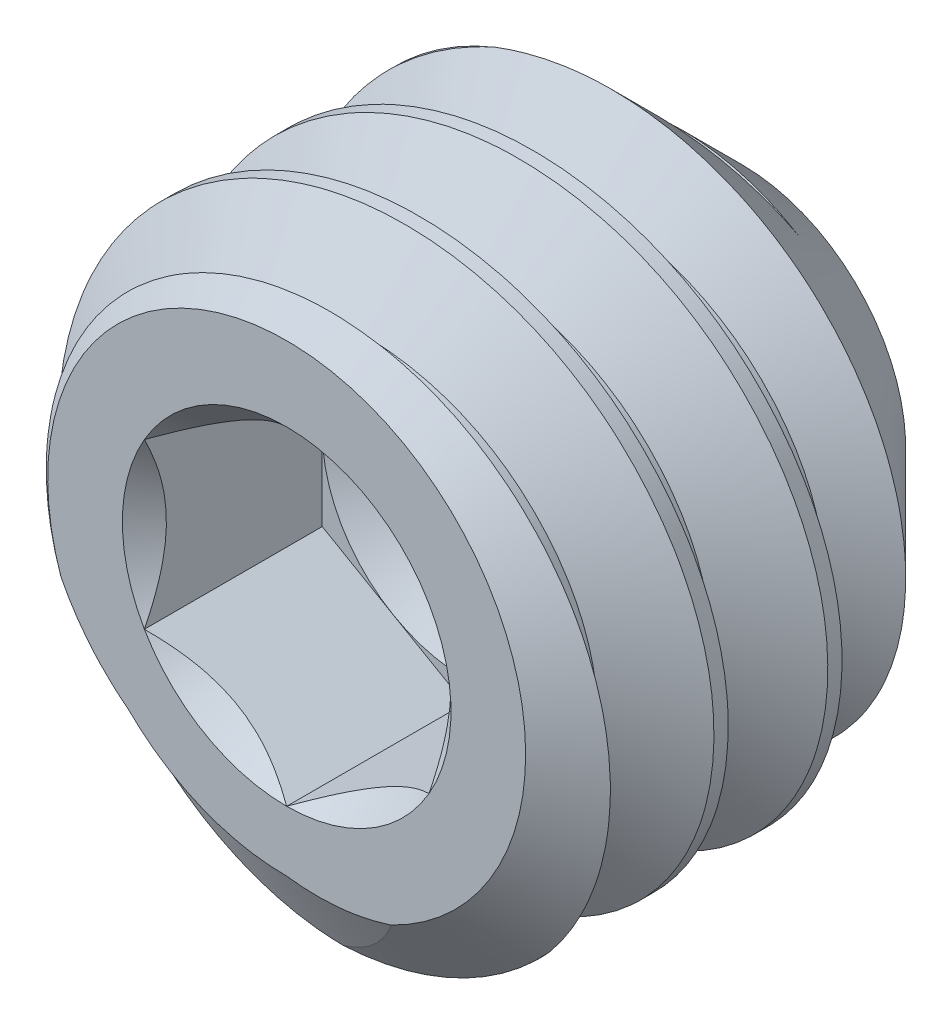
ISO-10303-21;
HEADER;
FILE_DESCRIPTION(('STEP AP214'),'2;1');
FILE_NAME('part.step','',(''),(''),'','','');
FILE_SCHEMA(('AUTOMOTIVE_DESIGN { 1 0 10303 214 1 1 1 1 }'));
ENDSEC;
DATA;
#1=APPLICATION_CONTEXT('core data for automotive mechanical design processes');
#2=APPLICATION_PROTOCOL_DEFINITION('international standard','automotive_design',2000,#1);
#3=PRODUCT_CONTEXT('',#1,'mechanical');
#4=PRODUCT('Part','Part','',(#3));
#5=PRODUCT_RELATED_PRODUCT_CATEGORY('part','',(#4));
#6=PRODUCT_DEFINITION_FORMATION('','',#4);
#7=PRODUCT_DEFINITION_CONTEXT('part definition',#1,'design');
#8=PRODUCT_DEFINITION('design','',#6,#7);
#9=PRODUCT_DEFINITION_SHAPE('','',#8);
#10=(LENGTH_UNIT() NAMED_UNIT(*) SI_UNIT(.MILLI.,.METRE.));
#11=(NAMED_UNIT(*) PLANE_ANGLE_UNIT() SI_UNIT($,.RADIAN.));
#12=(NAMED_UNIT(*) SI_UNIT($,.STERADIAN.) SOLID_ANGLE_UNIT());
#13=UNCERTAINTY_MEASURE_WITH_UNIT(LENGTH_MEASURE(1.E-05),#10,'distance_accuracy_value','');
#14=(GEOMETRIC_REPRESENTATION_CONTEXT(3) GLOBAL_UNCERTAINTY_ASSIGNED_CONTEXT((#13)) GLOBAL_UNIT_ASSIGNED_CONTEXT((#10,
#11,#12)) REPRESENTATION_CONTEXT('',''));
#15=CARTESIAN_POINT('',(0.,0.,0.));
#16=DIRECTION('',(0.,0.,1.));
#17=DIRECTION('',(1.,0.,0.));
#18=AXIS2_PLACEMENT_3D('',#15,#16,#17);
#19=CARTESIAN_POINT('',(0.9921875,0.57283972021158,0.00438412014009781));
#20=DIRECTION('',(0.,0.,-1.));
#21=DIRECTION('',(-1.,0.,0.));
#22=AXIS2_PLACEMENT_3D('',#19,#20,#21);
#23=PLANE('',#22);
#24=DIRECTION('',(0.,-1.,0.));
#25=VECTOR('',#24,1.);
#26=CARTESIAN_POINT('',(-0.9921875,0.57283972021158,0.00438412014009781));
#27=LINE('',#26,#25);
#28=CARTESIAN_POINT('',(-0.9921875,0.57283972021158,0.00438412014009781));
#29=VERTEX_POINT('',#28);
#30=CARTESIAN_POINT('',(-0.9921875,0.,0.00438412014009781));
#31=VERTEX_POINT('',#30);
#32=EDGE_CURVE('E189',#29,#31,#27,.T.);
#33=ORIENTED_EDGE('',*,*,#32,.T.);
#34=CARTESIAN_POINT('',(0.,0.,0.00438412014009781));
#35=DIRECTION('',(0.,0.,1.));
#36=DIRECTION('',(1.,0.,0.));
#37=AXIS2_PLACEMENT_3D('',#34,#35,#36);
#38=CIRCLE('',#37,0.992187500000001);
#39=CARTESIAN_POINT('',(-0.49609375,0.859259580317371,0.00438412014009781));
#40=VERTEX_POINT('',#39);
#41=EDGE_CURVE('E55',#40,#31,#38,.T.);
#42=ORIENTED_EDGE('',*,*,#41,.F.);
#43=DIRECTION('',(-0.866025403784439,-0.5,0.));
#44=VECTOR('',#43,1.);
#45=CARTESIAN_POINT('',(0.,1.14567944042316,0.00438412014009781));
#46=LINE('',#45,#44);
#47=EDGE_CURVE('E179',#40,#29,#46,.T.);
#48=ORIENTED_EDGE('',*,*,#47,.T.);
#49=EDGE_LOOP('',(#33,#42,#48));
#50=FACE_BOUND('',#49,.T.);
#51=ADVANCED_FACE('F34',(#50),#23,.F.);
#52=CARTESIAN_POINT('',(0.,1.14567944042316,0.00438412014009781));
#53=VERTEX_POINT('',#52);
#54=EDGE_CURVE('E167',#53,#40,#46,.T.);
#55=ORIENTED_EDGE('',*,*,#54,.T.);
#56=CARTESIAN_POINT('',(0.49609375,0.859259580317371,0.00438412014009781));
#57=VERTEX_POINT('',#56);
#58=EDGE_CURVE('E153',#57,#40,#38,.T.);
#59=ORIENTED_EDGE('',*,*,#58,.F.);
#60=DIRECTION('',(-0.866025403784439,0.5,0.));
#61=VECTOR('',#60,1.);
#62=CARTESIAN_POINT('',(0.9921875,0.57283972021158,0.00438412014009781));
#63=LINE('',#62,#61);
#64=EDGE_CURVE('E164',#57,#53,#63,.T.);
#65=ORIENTED_EDGE('',*,*,#64,.T.);
#66=EDGE_LOOP('',(#55,#59,#65));
#67=FACE_BOUND('',#66,.T.);
#68=ADVANCED_FACE('F163',(#67),#23,.F.);
#69=CARTESIAN_POINT('',(0.9921875,0.57283972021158,0.00438412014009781));
#70=VERTEX_POINT('',#69);
#71=EDGE_CURVE('E171',#70,#57,#63,.T.);
#72=ORIENTED_EDGE('',*,*,#71,.T.);
#73=CARTESIAN_POINT('',(0.9921875,0.,0.00438412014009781));
#74=VERTEX_POINT('',#73);
#75=EDGE_CURVE('E151',#74,#57,#38,.T.);
#76=ORIENTED_EDGE('',*,*,#75,.F.);
#77=DIRECTION('',(0.,1.,0.));
#78=VECTOR('',#77,1.);
#79=CARTESIAN_POINT('',(0.9921875,-0.572839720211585,0.00438412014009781));
#80=LINE('',#79,#78);
#81=EDGE_CURVE('E177',#74,#70,#80,.T.);
#82=ORIENTED_EDGE('',*,*,#81,.T.);
#83=EDGE_LOOP('',(#72,#76,#82));
#84=FACE_BOUND('',#83,.T.);
#85=ADVANCED_FACE('F176',(#84),#23,.F.);
#86=CARTESIAN_POINT('',(0.9921875,-0.572839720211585,0.00438412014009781));
#87=VERTEX_POINT('',#86);
#88=EDGE_CURVE('E200',#87,#74,#80,.T.);
#89=ORIENTED_EDGE('',*,*,#88,.T.);
#90=CARTESIAN_POINT('',(0.49609375,-0.859259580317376,0.00438412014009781));
#91=VERTEX_POINT('',#90);
#92=EDGE_CURVE('E155',#91,#74,#38,.T.);
#93=ORIENTED_EDGE('',*,*,#92,.F.);
#94=DIRECTION('',(0.866025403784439,0.5,0.));
#95=VECTOR('',#94,1.);
#96=CARTESIAN_POINT('',(0.,-1.14567944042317,0.00438412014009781));
#97=LINE('',#96,#95);
#98=EDGE_CURVE('E196',#91,#87,#97,.T.);
#99=ORIENTED_EDGE('',*,*,#98,.T.);
#100=EDGE_LOOP('',(#89,#93,#99));
#101=FACE_BOUND('',#100,.T.);
#102=ADVANCED_FACE('F398',(#101),#23,.F.);
#103=CARTESIAN_POINT('',(0.,-1.14567944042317,0.00438412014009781));
#104=VERTEX_POINT('',#103);
#105=EDGE_CURVE('E197',#104,#91,#97,.T.);
#106=ORIENTED_EDGE('',*,*,#105,.T.);
#107=CARTESIAN_POINT('',(-0.49609375,-0.859259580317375,0.00438412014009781));
#108=VERTEX_POINT('',#107);
#109=EDGE_CURVE('E408',#108,#91,#38,.T.);
#110=ORIENTED_EDGE('',*,*,#109,.F.);
#111=DIRECTION('',(0.866025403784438,-0.5,0.));
#112=VECTOR('',#111,1.);
#113=CARTESIAN_POINT('',(-0.9921875,-0.572839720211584,0.00438412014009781));
#114=LINE('',#113,#112);
#115=EDGE_CURVE('E192',#108,#104,#114,.T.);
#116=ORIENTED_EDGE('',*,*,#115,.T.);
#117=EDGE_LOOP('',(#106,#110,#116));
#118=FACE_BOUND('',#117,.T.);
#119=ADVANCED_FACE('F388',(#118),#23,.F.);
#120=CARTESIAN_POINT('',(0.,0.,1.2446184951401));
#121=DIRECTION('',(0.,0.,-1.));
#122=DIRECTION('',(0.,1.,0.));
#123=AXIS2_PLACEMENT_3D('',#120,#121,#122);
#124=PLANE('',#123);
#125=CARTESIAN_POINT('',(0.,0.,1.2446184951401));
#126=DIRECTION('',(0.,0.,1.));
#127=DIRECTION('',(1.,0.,0.));
#128=AXIS2_PLACEMENT_3D('',#125,#126,#127);
#129=CIRCLE('',#128,1.14567944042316);
#130=CARTESIAN_POINT('',(0.,1.14567944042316,1.2446184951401));
#131=VERTEX_POINT('',#130);
#132=CARTESIAN_POINT('',(-0.992187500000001,0.572839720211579,1.2446184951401));
#133=VERTEX_POINT('',#132);
#134=EDGE_CURVE('E424',#131,#133,#129,.T.);
#135=ORIENTED_EDGE('',*,*,#134,.F.);
#136=CARTESIAN_POINT('',(0.9921875,0.572839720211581,1.2446184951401));
#137=VERTEX_POINT('',#136);
#138=EDGE_CURVE('E420',#137,#131,#129,.T.);
#139=ORIENTED_EDGE('',*,*,#138,.F.);
#140=CARTESIAN_POINT('',(0.992187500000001,-0.572839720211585,1.2446184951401));
#141=VERTEX_POINT('',#140);
#142=EDGE_CURVE('E62',#141,#137,#129,.T.);
#143=ORIENTED_EDGE('',*,*,#142,.F.);
#144=CARTESIAN_POINT('',(0.,-1.14567944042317,1.2446184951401));
#145=VERTEX_POINT('',#144);
#146=EDGE_CURVE('E473',#145,#141,#129,.T.);
#147=ORIENTED_EDGE('',*,*,#146,.F.);
#148=CARTESIAN_POINT('',(-0.9921875,-0.572839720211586,1.2446184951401));
#149=VERTEX_POINT('',#148);
#150=EDGE_CURVE('E470',#149,#145,#129,.T.);
#151=ORIENTED_EDGE('',*,*,#150,.F.);
#152=EDGE_CURVE('E469',#133,#149,#129,.T.);
#153=ORIENTED_EDGE('',*,*,#152,.F.);
#154=EDGE_LOOP('',(#135,#139,#143,#147,#151,#153));
#155=FACE_BOUND('',#154,.T.);
#156=CARTESIAN_POINT('',(1.68623488,-0.698168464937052,1.2446184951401));
#157=CARTESIAN_POINT('',(1.66120221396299,-0.742416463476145,1.2446184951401));
#158=CARTESIAN_POINT('',(1.63429706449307,-0.785604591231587,1.2446184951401));
#159=CARTESIAN_POINT('',(1.57694695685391,-0.869578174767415,1.2446184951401));
#160=CARTESIAN_POINT('',(1.54650115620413,-0.910363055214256,1.2446184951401));
#161=CARTESIAN_POINT('',(1.48218491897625,-0.989351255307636,1.2446184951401));
#162=CARTESIAN_POINT('',(1.448303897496,-1.02754595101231,1.2446184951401));
#163=CARTESIAN_POINT('',(1.37744642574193,-1.10092834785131,1.2446184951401));
#164=CARTESIAN_POINT('',(1.34047114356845,-1.13611717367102,1.2446184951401));
#165=CARTESIAN_POINT('',(1.28284069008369,-1.18652168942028,1.2446184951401));
#166=CARTESIAN_POINT('',(1.26323518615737,-1.20295183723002,1.2446184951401));
#167=CARTESIAN_POINT('',(1.22333947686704,-1.23495051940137,1.2446184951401));
#168=CARTESIAN_POINT('',(1.2030494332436,-1.25051925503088,1.2446184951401));
#169=CARTESIAN_POINT('',(1.14111679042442,-1.29576267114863,1.2446184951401));
#170=CARTESIAN_POINT('',(1.09839920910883,-1.32398560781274,1.2446184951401));
#171=CARTESIAN_POINT('',(1.0106021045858,-1.37629465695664,1.2446184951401));
#172=CARTESIAN_POINT('',(0.965526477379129,-1.40038732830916,1.2446184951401));
#173=CARTESIAN_POINT('',(0.873332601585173,-1.44426689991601,1.2446184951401));
#174=CARTESIAN_POINT('',(0.826214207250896,-1.46405349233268,1.2446184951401));
#175=CARTESIAN_POINT('',(0.690120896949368,-1.51385276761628,1.2446184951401));
#176=CARTESIAN_POINT('',(0.599140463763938,-1.53855124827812,1.2446184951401));
#177=CARTESIAN_POINT('',(0.4143392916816,-1.57197747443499,1.2446184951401));
#178=CARTESIAN_POINT('',(0.320520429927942,-1.58071555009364,1.2446184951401));
#179=CARTESIAN_POINT('',(0.18880007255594,-1.581654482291,1.2446184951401));
#180=CARTESIAN_POINT('',(0.150857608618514,-1.58060320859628,1.24461849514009));
#181=CARTESIAN_POINT('',(0.0752253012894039,-1.57587854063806,1.2446184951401));
#182=CARTESIAN_POINT('',(0.0375350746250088,-1.57221128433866,1.2446184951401));
#183=CARTESIAN_POINT('',(0.,-1.56724425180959,1.24461849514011));
#184=B_SPLINE_CURVE_WITH_KNOTS('',3,(#156,#157,#158,#159,#160,#161,#162,#163,#164,#165,#166,
#167,#168,#169,#170,#171,#172,#173,#174,#175,#176,#177,#178,#179,#180,#181,#182,#183),
.UNSPECIFIED.,.F.,.F.,(4,2,2,2,2,2,2,2,2,2,2,2,2,4),(0.,0.152469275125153,0.304974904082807,
0.457965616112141,0.610898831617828,0.68761865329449,0.76432047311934,0.917674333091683,
1.07078236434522,1.22390133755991,1.50525820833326,1.78643290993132,1.90022977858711,
2.01376051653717),.UNSPECIFIED.);
#185=CARTESIAN_POINT('',(0.726167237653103,-1.49967892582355,1.2446184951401));
#186=VERTEX_POINT('',#185);
#187=CARTESIAN_POINT('',(0.,-1.56724425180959,1.2446184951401));
#188=VERTEX_POINT('',#187);
#189=EDGE_CURVE('E336',#186,#188,#184,.T.);
#190=ORIENTED_EDGE('',*,*,#189,.F.);
#191=CARTESIAN_POINT('',(0.,0.,1.2446184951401));
#192=DIRECTION('',(0.,0.,1.));
#193=DIRECTION('',(0.,-1.,0.));
#194=AXIS2_PLACEMENT_3D('',#191,#192,#193);
#195=CIRCLE('',#194,1.66624);
#196=CARTESIAN_POINT('',(-1.57391091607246,-0.546955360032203,1.2446184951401));
#197=VERTEX_POINT('',#196);
#198=EDGE_CURVE('E298',#186,#197,#195,.T.);
#199=ORIENTED_EDGE('',*,*,#198,.T.);
#200=CARTESIAN_POINT('',(-1.1082090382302,-1.1082090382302,1.2446184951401));
#201=CARTESIAN_POINT('',(-1.14528675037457,-1.07979948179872,1.2446184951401));
#202=CARTESIAN_POINT('',(-1.18113214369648,-1.0498199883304,1.2446184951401));
#203=CARTESIAN_POINT('',(-1.25013679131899,-0.98691351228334,1.2446184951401));
#204=CARTESIAN_POINT('',(-1.28329600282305,-0.953986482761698,1.2446184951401));
#205=CARTESIAN_POINT('',(-1.37670013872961,-0.852924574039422,1.2446184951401));
#206=CARTESIAN_POINT('',(-1.4328913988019,-0.780951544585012,1.2446184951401));
#207=CARTESIAN_POINT('',(-1.52690596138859,-0.637307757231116,1.2446184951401));
#208=CARTESIAN_POINT('',(-1.56608409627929,-0.566512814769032,1.2446184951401));
#209=CARTESIAN_POINT('',(-1.63444450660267,-0.418203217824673,1.2446184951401));
#210=CARTESIAN_POINT('',(-1.66336731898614,-0.340568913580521,1.2446184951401));
#211=CARTESIAN_POINT('',(-1.68623488,-0.261142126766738,1.2446184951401));
#212=B_SPLINE_CURVE_WITH_KNOTS('',3,(#200,#201,#202,#203,#204,#205,#206,#207,#208,#209,#210,
#211),.UNSPECIFIED.,.F.,.F.,(4,2,2,2,2,4),(0.,0.140041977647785,0.280086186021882,
0.55262022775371,0.794512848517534,1.0421496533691),.UNSPECIFIED.);
#213=CARTESIAN_POINT('',(-1.1082090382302,-1.1082090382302,1.2446184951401));
#214=VERTEX_POINT('',#213);
#215=EDGE_CURVE('E259',#214,#197,#212,.T.);
#216=ORIENTED_EDGE('',*,*,#215,.F.);
#217=CARTESIAN_POINT('',(0.,-1.56724425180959,1.2446184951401));
#218=CARTESIAN_POINT('',(-0.033148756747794,-1.56724249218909,1.2446184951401));
#219=CARTESIAN_POINT('',(-0.0662825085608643,-1.56619160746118,1.2446184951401));
#220=CARTESIAN_POINT('',(-0.132463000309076,-1.56198971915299,1.2446184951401));
#221=CARTESIAN_POINT('',(-0.165509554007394,-1.55883578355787,1.2446184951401));
#222=CARTESIAN_POINT('',(-0.285712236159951,-1.54348580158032,1.2446184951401));
#223=CARTESIAN_POINT('',(-0.372153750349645,-1.52495751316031,1.2446184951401));
#224=CARTESIAN_POINT('',(-0.540791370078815,-1.47363373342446,1.2446184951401));
#225=CARTESIAN_POINT('',(-0.622979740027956,-1.44081320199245,1.2446184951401));
#226=CARTESIAN_POINT('',(-0.77687220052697,-1.3637281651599,1.2446184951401));
#227=CARTESIAN_POINT('',(-0.848891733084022,-1.32009754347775,1.2446184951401));
#228=CARTESIAN_POINT('',(-0.950908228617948,-1.24651196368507,1.2446184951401));
#229=CARTESIAN_POINT('',(-0.983910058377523,-1.22062836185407,1.2446184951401));
#230=CARTESIAN_POINT('',(-1.04773673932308,-1.16630051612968,1.2446184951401));
#231=CARTESIAN_POINT('',(-1.07856149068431,-1.13785615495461,1.2446184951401));
#232=CARTESIAN_POINT('',(-1.1082090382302,-1.1082090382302,1.2446184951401));
#233=B_SPLINE_CURVE_WITH_KNOTS('',3,(#217,#218,#219,#220,#221,#222,#223,#224,#225,#226,#227,
#228,#229,#230,#231,#232),.UNSPECIFIED.,.F.,.F.,(4,2,2,2,2,2,2,4),(0.,0.0993996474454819,
0.198938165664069,0.462762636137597,0.727051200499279,0.978491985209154,1.10419951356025,
1.22991280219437),.UNSPECIFIED.);
#234=EDGE_CURVE('E337',#188,#214,#233,.T.);
#235=ORIENTED_EDGE('',*,*,#234,.F.);
#236=EDGE_LOOP('',(#190,#199,#216,#235));
#237=FACE_BOUND('',#236,.T.);
#238=ADVANCED_FACE('F36',(#155,#237),#124,.F.);
#239=CARTESIAN_POINT('',(0.,0.,0.95294004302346));
#240=DIRECTION('',(0.,0.,-1.));
#241=DIRECTION('',(0.,1.,0.));
#242=AXIS2_PLACEMENT_3D('',#239,#240,#241);
#243=CONICAL_SURFACE('',#242,2.0828,0.95993108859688);
#244=CARTESIAN_POINT('',(0.102902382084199,-2.08025646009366,0.952940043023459));
#245=CARTESIAN_POINT('',(0.146464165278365,-2.0567719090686,0.967860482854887));
#246=CARTESIAN_POINT('',(0.188943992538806,-2.0314637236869,0.983080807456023));
#247=CARTESIAN_POINT('',(0.271423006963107,-1.97739181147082,1.01410448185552));
#248=CARTESIAN_POINT('',(0.311422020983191,-1.94862784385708,1.0299078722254));
#249=CARTESIAN_POINT('',(0.386812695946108,-1.88925988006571,1.0613271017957));
#250=CARTESIAN_POINT('',(0.422332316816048,-1.85880470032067,1.07691718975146));
#251=CARTESIAN_POINT('',(0.490556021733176,-1.79513282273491,1.108592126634));
#252=CARTESIAN_POINT('',(0.523260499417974,-1.76191651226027,1.12467690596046));
#253=CARTESIAN_POINT('',(0.58646126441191,-1.69198625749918,1.15777549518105));
#254=CARTESIAN_POINT('',(0.616871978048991,-1.65520119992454,1.17480269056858));
#255=CARTESIAN_POINT('',(0.674206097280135,-1.57919591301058,1.20934884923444));
#256=CARTESIAN_POINT('',(0.701127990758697,-1.53997463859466,1.22686802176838));
#257=CARTESIAN_POINT('',(0.726167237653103,-1.49967892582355,1.24461849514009));
#258=B_SPLINE_CURVE_WITH_KNOTS('',3,(#244,#245,#246,#247,#248,#249,#250,#251,#252,#253,#254,
#255,#256,#257),.UNSPECIFIED.,.F.,.F.,(4,2,2,2,2,2,4),(0.,0.155029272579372,0.310069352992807,
0.457863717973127,0.605637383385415,0.75747908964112,0.909386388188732),.UNSPECIFIED.);
#259=CARTESIAN_POINT('',(0.102902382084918,-2.08025646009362,0.952940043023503));
#260=VERTEX_POINT('',#259);
#261=EDGE_CURVE('E332',#260,#186,#258,.T.);
#262=ORIENTED_EDGE('',*,*,#261,.F.);
#263=CARTESIAN_POINT('',(0.,0.,0.95294004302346));
#264=DIRECTION('',(0.,0.,1.));
#265=DIRECTION('',(0.,-1.,0.));
#266=AXIS2_PLACEMENT_3D('',#263,#264,#265);
#267=CIRCLE('',#266,2.0828);
#268=CARTESIAN_POINT('',(1.54372642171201,-1.39820047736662,0.952940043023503));
#269=VERTEX_POINT('',#268);
#270=EDGE_CURVE('E350',#260,#269,#267,.T.);
#271=ORIENTED_EDGE('',*,*,#270,.T.);
#272=CARTESIAN_POINT('',(-1.57391091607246,-0.546955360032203,1.2446184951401));
#273=CARTESIAN_POINT('',(-1.5918934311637,-0.503861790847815,1.24263309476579));
#274=CARTESIAN_POINT('',(-1.60804281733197,-0.46000480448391,1.24065960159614));
#275=CARTESIAN_POINT('',(-1.63658370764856,-0.371093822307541,1.23674598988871));
#276=CARTESIAN_POINT('',(-1.64897604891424,-0.326040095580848,1.23480586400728));
#277=CARTESIAN_POINT('',(-1.66989888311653,-0.235134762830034,1.23097139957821));
#278=CARTESIAN_POINT('',(-1.67843686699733,-0.189284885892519,1.22907697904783));
#279=CARTESIAN_POINT('',(-1.69160218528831,-0.0970248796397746,1.22536022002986));
#280=CARTESIAN_POINT('',(-1.69622945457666,-0.0506147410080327,1.2235378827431));
#281=CARTESIAN_POINT('',(-1.70163641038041,0.0423900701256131,1.21990846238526));
#282=CARTESIAN_POINT('',(-1.70241926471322,0.0889845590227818,1.21810136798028));
#283=CARTESIAN_POINT('',(-1.70026534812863,0.182074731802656,1.21443009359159));
#284=CARTESIAN_POINT('',(-1.69732843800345,0.22857041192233,1.21256591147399));
#285=CARTESIAN_POINT('',(-1.68290061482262,0.367507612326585,1.2069363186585));
#286=CARTESIAN_POINT('',(-1.66579435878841,0.459429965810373,1.20313267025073));
#287=CARTESIAN_POINT('',(-1.61590741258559,0.643602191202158,1.19533442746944));
#288=CARTESIAN_POINT('',(-1.58241639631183,0.735657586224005,1.19133939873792));
#289=CARTESIAN_POINT('',(-1.50041551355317,0.91285968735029,1.18345515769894));
#290=CARTESIAN_POINT('',(-1.45190932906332,0.998008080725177,1.17956591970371));
#291=CARTESIAN_POINT('',(-1.36903436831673,1.11863235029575,1.17388286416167));
#292=CARTESIAN_POINT('',(-1.33971796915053,1.15766302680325,1.17201336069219));
#293=CARTESIAN_POINT('',(-1.27789070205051,1.23311279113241,1.16835042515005));
#294=CARTESIAN_POINT('',(-1.24537958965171,1.26953167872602,1.16655699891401));
#295=CARTESIAN_POINT('',(-1.14358350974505,1.37469188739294,1.1610976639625));
#296=CARTESIAN_POINT('',(-1.07001495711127,1.43936665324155,1.15735143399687));
#297=CARTESIAN_POINT('',(-0.911349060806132,1.55758161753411,1.14967738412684));
#298=CARTESIAN_POINT('',(-0.825994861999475,1.61077556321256,1.14574739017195));
#299=CARTESIAN_POINT('',(-0.647709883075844,1.70232356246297,1.13791104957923));
#300=CARTESIAN_POINT('',(-0.55478231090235,1.74068386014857,1.13400469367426));
#301=CARTESIAN_POINT('',(-0.362158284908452,1.80210378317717,1.12623311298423));
#302=CARTESIAN_POINT('',(-0.262370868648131,1.82487928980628,1.12236985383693));
#303=CARTESIAN_POINT('',(-0.0603543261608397,1.85328576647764,1.11492126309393));
#304=CARTESIAN_POINT('',(0.0418759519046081,1.8589084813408,1.11133606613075));
#305=CARTESIAN_POINT('',(0.246749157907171,1.85363650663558,1.10393261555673));
#306=CARTESIAN_POINT('',(0.349388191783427,1.84260081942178,1.10011263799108));
#307=CARTESIAN_POINT('',(0.551500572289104,1.80398148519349,1.09242079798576));
#308=CARTESIAN_POINT('',(0.650974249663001,1.77639957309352,1.08854894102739));
#309=CARTESIAN_POINT('',(0.847393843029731,1.70423406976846,1.08071664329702));
#310=CARTESIAN_POINT('',(0.944139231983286,1.659104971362,1.076757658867));
#311=CARTESIAN_POINT('',(1.1287281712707,1.55320227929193,1.06897981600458));
#312=CARTESIAN_POINT('',(1.21657154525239,1.49242837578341,1.06516096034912));
#313=CARTESIAN_POINT('',(1.33959297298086,1.39094744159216,1.05965658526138));
#314=CARTESIAN_POINT('',(1.37913521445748,1.35540927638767,1.05785947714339));
#315=CARTESIAN_POINT('',(1.45522623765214,1.28126053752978,1.05421207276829));
#316=CARTESIAN_POINT('',(1.49177483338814,1.24264977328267,1.05236177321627));
#317=CARTESIAN_POINT('',(1.59655203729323,1.12255839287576,1.0467589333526));
#318=CARTESIAN_POINT('',(1.6599537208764,1.03678414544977,1.04295264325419));
#319=CARTESIAN_POINT('',(1.77409534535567,0.852857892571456,1.03516405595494));
#320=CARTESIAN_POINT('',(1.8242982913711,0.754371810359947,1.03118034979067));
#321=CARTESIAN_POINT('',(1.88670471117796,0.601534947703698,1.02526312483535));
#322=CARTESIAN_POINT('',(1.90535825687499,0.54973326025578,1.02330026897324));
#323=CARTESIAN_POINT('',(1.93828025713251,0.44469477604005,1.01940424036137));
#324=CARTESIAN_POINT('',(1.95254526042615,0.391456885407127,1.01747109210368));
#325=CARTESIAN_POINT('',(1.97662577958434,0.283712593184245,1.01363555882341));
#326=CARTESIAN_POINT('',(1.98641922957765,0.229201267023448,1.01173337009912));
#327=CARTESIAN_POINT('',(2.00136623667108,0.119519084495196,1.00799785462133));
#328=CARTESIAN_POINT('',(2.00651775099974,0.0643479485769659,1.00616455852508));
#329=CARTESIAN_POINT('',(2.01222853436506,-0.046243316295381,1.00251505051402));
#330=CARTESIAN_POINT('',(2.01278653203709,-0.101663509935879,1.00069884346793));
#331=CARTESIAN_POINT('',(2.0094361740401,-0.212343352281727,0.997005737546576));
#332=CARTESIAN_POINT('',(2.00552949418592,-0.267603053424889,0.995128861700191));
#333=CARTESIAN_POINT('',(1.99312205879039,-0.378685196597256,0.991314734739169));
#334=CARTESIAN_POINT('',(1.98453445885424,-0.434498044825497,0.989377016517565));
#335=CARTESIAN_POINT('',(1.96279867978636,-0.545151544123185,0.985486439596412));
#336=CARTESIAN_POINT('',(1.94965507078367,-0.599993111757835,0.983533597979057));
#337=CARTESIAN_POINT('',(1.90348194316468,-0.762601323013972,0.977671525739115));
#338=CARTESIAN_POINT('',(1.86369885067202,-0.868551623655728,0.973755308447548));
#339=CARTESIAN_POINT('',(1.77927191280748,-1.04704287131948,0.966981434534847));
#340=CARTESIAN_POINT('',(1.73828162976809,-1.12135197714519,0.964102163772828));
#341=CARTESIAN_POINT('',(1.64746813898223,-1.2642798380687,0.958440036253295));
#342=CARTESIAN_POINT('',(1.59765212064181,-1.33290315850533,0.955657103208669));
#343=CARTESIAN_POINT('',(1.54372642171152,-1.39820047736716,0.95294004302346));
#344=B_SPLINE_CURVE_WITH_KNOTS('',3,(#272,#273,#274,#275,#276,#277,#278,#279,#280,#281,#282,
#283,#284,#285,#286,#287,#288,#289,#290,#291,#292,#293,#294,#295,#296,#297,#298,#299,#300,#301,
#302,#303,#304,#305,#306,#307,#308,#309,#310,#311,#312,#313,#314,#315,#316,#317,#318,#319,#320,
#321,#322,#323,#324,#325,#326,#327,#328,#329,#330,#331,#332,#333,#334,#335,#336,#337,#338,#339,
#340,#341,#342,#343),.UNSPECIFIED.,.F.,.F.,(4,2,2,2,2,2,2,2,2,2,2,2,2,2,2,2,2,2,2,2,2,2,2,2,2,2,
2,2,2,2,2,2,2,2,2,4),(0.,0.140167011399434,0.280302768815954,0.420164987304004,0.56002953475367,
0.699778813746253,0.8395333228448,1.11895116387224,1.41172862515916,1.70443434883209,
1.85083376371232,1.99724439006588,2.28995752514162,2.59054331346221,2.89100243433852,
3.19680274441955,3.50275020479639,3.81130178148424,4.11982101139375,4.43881632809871,
4.75781796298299,4.91724963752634,5.07669120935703,5.39541383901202,5.72559204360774,
5.89071016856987,6.05595781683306,6.22201232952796,6.38813988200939,6.55431341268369,
6.72042459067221,6.88972803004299,7.05886213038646,7.39683138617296,7.65096672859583,
7.90489599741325),.UNSPECIFIED.);
#345=EDGE_CURVE('E248',#197,#269,#344,.T.);
#346=ORIENTED_EDGE('',*,*,#345,.F.);
#347=ORIENTED_EDGE('',*,*,#198,.F.);
#348=EDGE_LOOP('',(#262,#271,#346,#347));
#349=FACE_BOUND('',#348,.T.);
#350=ADVANCED_FACE('F264',(#349),#243,.T.);
#351=CARTESIAN_POINT('',(0.,0.,-1.9303815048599));
#352=DIRECTION('',(0.,0.,1.));
#353=DIRECTION('',(0.,-1.,0.));
#354=AXIS2_PLACEMENT_3D('',#351,#352,#353);
#355=CONICAL_SURFACE('',#354,1.14130130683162,0.785398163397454);
#356=CARTESIAN_POINT('',(0.,0.,-1.9303815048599));
#357=DIRECTION('',(0.,0.,1.));
#358=DIRECTION('',(0.,-1.,0.));
#359=AXIS2_PLACEMENT_3D('',#356,#357,#358);
#360=CIRCLE('',#359,1.14130130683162);
#361=CARTESIAN_POINT('',(0.,-1.14130130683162,-1.93038150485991));
#362=VERTEX_POINT('',#361);
#363=EDGE_CURVE('E345',#362,#362,#360,.T.);
#364=ORIENTED_EDGE('',*,*,#363,.T.);
#365=EDGE_LOOP('',(#364));
#366=FACE_BOUND('',#365,.T.);
#367=CARTESIAN_POINT('',(-0.362746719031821,1.5246866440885,-1.50443855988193));
#368=CARTESIAN_POINT('',(-0.406504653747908,1.51664089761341,-1.50213833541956));
#369=CARTESIAN_POINT('',(-0.449902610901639,1.50674696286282,-1.49982806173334));
#370=CARTESIAN_POINT('',(-0.535706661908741,1.48333385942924,-1.4952032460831));
#371=CARTESIAN_POINT('',(-0.57811280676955,1.46981487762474,-1.49288870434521));
#372=CARTESIAN_POINT('',(-0.70318565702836,1.42401954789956,-1.48597625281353));
#373=CARTESIAN_POINT('',(-0.7839790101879,1.38645443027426,-1.48139518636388));
#374=CARTESIAN_POINT('',(-0.938174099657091,1.29824717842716,-1.47238832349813));
#375=CARTESIAN_POINT('',(-1.01157055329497,1.24759578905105,-1.46796263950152));
#376=CARTESIAN_POINT('',(-1.1144381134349,1.16293984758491,-1.46158195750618));
#377=CARTESIAN_POINT('',(-1.14753984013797,1.13325502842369,-1.4594969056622));
#378=CARTESIAN_POINT('',(-1.21123569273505,1.07129599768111,-1.45526728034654));
#379=CARTESIAN_POINT('',(-1.24182961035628,1.03902157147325,-1.45312270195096));
#380=CARTESIAN_POINT('',(-1.30066485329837,0.971674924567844,-1.44876514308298));
#381=CARTESIAN_POINT('',(-1.32887166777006,0.93657256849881,-1.44655164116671));
#382=CARTESIAN_POINT('',(-1.38230072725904,0.864182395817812,-1.4420982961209));
#383=CARTESIAN_POINT('',(-1.40752314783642,0.82689470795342,-1.43985845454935));
#384=CARTESIAN_POINT('',(-1.47844982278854,0.712123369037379,-1.43312261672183));
#385=CARTESIAN_POINT('',(-1.51946399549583,0.631673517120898,-1.42860656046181));
#386=CARTESIAN_POINT('',(-1.58866242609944,0.462891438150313,-1.41953272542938));
#387=CARTESIAN_POINT('',(-1.6164735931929,0.374405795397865,-1.41497706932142));
#388=CARTESIAN_POINT('',(-1.64675206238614,0.239199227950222,-1.40829150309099));
#389=CARTESIAN_POINT('',(-1.65493967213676,0.193695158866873,-1.40608662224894));
#390=CARTESIAN_POINT('',(-1.66743875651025,0.102142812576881,-1.40175527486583));
#391=CARTESIAN_POINT('',(-1.67175018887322,0.0560945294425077,-1.39962880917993));
#392=CARTESIAN_POINT('',(-1.67652403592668,-0.0361272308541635,-1.39540305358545));
#393=CARTESIAN_POINT('',(-1.67699239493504,-0.0823004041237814,-1.39330372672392));
#394=CARTESIAN_POINT('',(-1.67420939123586,-0.174520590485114,-1.38903371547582));
#395=CARTESIAN_POINT('',(-1.67095794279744,-0.220567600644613,-1.38686302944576));
#396=CARTESIAN_POINT('',(-1.6555960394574,-0.358092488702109,-1.38030564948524));
#397=CARTESIAN_POINT('',(-1.63788076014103,-0.449008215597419,-1.37587117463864));
#398=CARTESIAN_POINT('',(-1.58702391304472,-0.630182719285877,-1.36681079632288));
#399=CARTESIAN_POINT('',(-1.55331042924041,-0.720279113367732,-1.3621841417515));
#400=CARTESIAN_POINT('',(-1.4711985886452,-0.893555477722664,-1.35304541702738));
#401=CARTESIAN_POINT('',(-1.42280399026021,-0.976737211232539,-1.34853331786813));
#402=CARTESIAN_POINT('',(-1.34032405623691,-1.09446963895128,-1.34193421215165));
#403=CARTESIAN_POINT('',(-1.31116813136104,-1.13255522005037,-1.33976178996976));
#404=CARTESIAN_POINT('',(-1.24974091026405,-1.20613257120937,-1.33550410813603));
#405=CARTESIAN_POINT('',(-1.21746941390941,-1.24162417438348,-1.33341885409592));
#406=CARTESIAN_POINT('',(-1.1164724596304,-1.34399702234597,-1.32706820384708));
#407=CARTESIAN_POINT('',(-1.04354126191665,-1.4068091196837,-1.32270627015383));
#408=CARTESIAN_POINT('',(-0.886770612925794,-1.52099965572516,-1.31378563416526));
#409=CARTESIAN_POINT('',(-0.802725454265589,-1.57209426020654,-1.30922471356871));
#410=CARTESIAN_POINT('',(-0.62736109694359,-1.65964347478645,-1.30012388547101));
#411=CARTESIAN_POINT('',(-0.536044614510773,-1.69610352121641,-1.29558397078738));
#412=CARTESIAN_POINT('',(-0.347238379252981,-1.75383692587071,-1.28656333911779));
#413=CARTESIAN_POINT('',(-0.249677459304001,-1.77487844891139,-1.28208448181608));
#414=CARTESIAN_POINT('',(-0.0523740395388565,-1.80022564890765,-1.27343995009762));
#415=CARTESIAN_POINT('',(0.0473693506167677,-1.80452436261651,-1.26927440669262));
#416=CARTESIAN_POINT('',(0.246937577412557,-1.79689709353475,-1.26066452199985));
#417=CARTESIAN_POINT('',(0.346757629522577,-1.7848516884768,-1.25621835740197));
#418=CARTESIAN_POINT('',(0.543075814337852,-1.74458745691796,-1.24726481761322));
#419=CARTESIAN_POINT('',(0.639574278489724,-1.71637024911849,-1.24275744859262));
#420=CARTESIAN_POINT('',(0.829267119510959,-1.64354037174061,-1.23366308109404));
#421=CARTESIAN_POINT('',(0.922294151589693,-1.59849215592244,-1.22907737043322));
#422=CARTESIAN_POINT('',(1.09950624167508,-1.49336141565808,-1.22007178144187));
#423=CARTESIAN_POINT('',(1.18369107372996,-1.43327850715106,-1.21565190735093));
#424=CARTESIAN_POINT('',(1.30136876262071,-1.33329673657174,-1.20926855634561));
#425=CARTESIAN_POINT('',(1.33915554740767,-1.29833354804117,-1.20718219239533));
#426=CARTESIAN_POINT('',(1.41177701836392,-1.22545136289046,-1.2029381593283));
#427=CARTESIAN_POINT('',(1.44661153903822,-1.18753220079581,-1.20078048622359));
#428=CARTESIAN_POINT('',(1.51308159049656,-1.1089689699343,-1.19642696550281));
#429=CARTESIAN_POINT('',(1.54471619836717,-1.0683241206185,-1.19423110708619));
#430=CARTESIAN_POINT('',(1.60456465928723,-0.984607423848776,-1.18981305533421));
#431=CARTESIAN_POINT('',(1.63277862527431,-0.941535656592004,-1.18759086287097));
#432=CARTESIAN_POINT('',(1.71362972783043,-0.806365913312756,-1.18077070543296));
#433=CARTESIAN_POINT('',(1.76045117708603,-0.710699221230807,-1.1761514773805));
#434=CARTESIAN_POINT('',(1.83738385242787,-0.512900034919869,-1.16700204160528));
#435=CARTESIAN_POINT('',(1.8675000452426,-0.410769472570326,-1.16247180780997));
#436=CARTESIAN_POINT('',(1.89960198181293,-0.254772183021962,-1.15581311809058));
#437=CARTESIAN_POINT('',(1.90812838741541,-0.202180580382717,-1.15361137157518));
#438=CARTESIAN_POINT('',(1.92070251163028,-0.096448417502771,-1.14929525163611));
#439=CARTESIAN_POINT('',(1.92475009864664,-0.0433078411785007,-1.14718088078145));
#440=CARTESIAN_POINT('',(1.92843925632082,0.0631435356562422,-1.1429443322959));
#441=CARTESIAN_POINT('',(1.92807909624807,0.116454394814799,-1.14082215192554));
#442=CARTESIAN_POINT('',(1.92303080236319,0.222855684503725,-1.13651465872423));
#443=CARTESIAN_POINT('',(1.91834256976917,0.275946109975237,-1.13432934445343));
#444=CARTESIAN_POINT('',(1.89755842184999,0.436094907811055,-1.12765567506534));
#445=CARTESIAN_POINT('',(1.87468446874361,0.542357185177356,-1.1231159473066));
#446=CARTESIAN_POINT('',(1.81171993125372,0.749536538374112,-1.11402812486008));
#447=CARTESIAN_POINT('',(1.77163461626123,0.85045523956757,-1.10948003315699));
#448=CARTESIAN_POINT('',(1.67448368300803,1.04597040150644,-1.10041904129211));
#449=CARTESIAN_POINT('',(1.61714503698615,1.14043274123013,-1.09590800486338));
#450=CARTESIAN_POINT('',(1.5199159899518,1.27382980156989,-1.08932359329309));
#451=CARTESIAN_POINT('',(1.48561308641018,1.3169352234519,-1.08715794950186));
#452=CARTESIAN_POINT('',(1.41349845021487,1.40010991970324,-1.08289897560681));
#453=CARTESIAN_POINT('',(1.37568648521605,1.44017899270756,-1.08080565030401));
#454=CARTESIAN_POINT('',(1.25727149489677,1.55580949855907,-1.07440607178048));
#455=CARTESIAN_POINT('',(1.17186627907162,1.62655399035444,-1.06999084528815));
#456=CARTESIAN_POINT('',(0.99067802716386,1.7530830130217,-1.0610756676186));
#457=CARTESIAN_POINT('',(0.894895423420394,1.80886816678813,-1.05657571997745));
#458=CARTESIAN_POINT('',(0.692686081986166,1.90538697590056,-1.04747106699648));
#459=CARTESIAN_POINT('',(0.586035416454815,1.94565204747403,-1.04286698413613));
#460=CARTESIAN_POINT('',(0.367399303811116,2.00771277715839,-1.03378851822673));
#461=CARTESIAN_POINT('',(0.255412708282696,2.02950444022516,-1.02931416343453));
#462=CARTESIAN_POINT('',(0.086022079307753,2.04780532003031,-1.02286086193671));
#463=CARTESIAN_POINT('',(0.0293116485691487,2.05150712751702,-1.02075239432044));
#464=CARTESIAN_POINT('',(-0.0842424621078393,2.05422910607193,-1.01650955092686));
#465=CARTESIAN_POINT('',(-0.141086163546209,2.05324846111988,-1.01437517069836));
#466=CARTESIAN_POINT('',(-0.254446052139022,2.04665642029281,-1.01005056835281));
#467=CARTESIAN_POINT('',(-0.31096248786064,2.04104918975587,-1.00786039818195));
#468=CARTESIAN_POINT('',(-0.423325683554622,2.02523782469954,-1.0034513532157));
#469=CARTESIAN_POINT('',(-0.479172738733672,2.01503579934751,-1.00123249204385));
#470=CARTESIAN_POINT('',(-0.576316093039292,1.99315535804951,-0.99732172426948));
#471=CARTESIAN_POINT('',(-0.617833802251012,1.9824466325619,-0.995633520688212));
#472=CARTESIAN_POINT('',(-0.700048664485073,1.95851228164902,-0.992257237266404));
#473=CARTESIAN_POINT('',(-0.740747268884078,1.94529164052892,-0.990569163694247));
#474=CARTESIAN_POINT('',(-0.781002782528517,1.93082637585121,-0.988882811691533));
#475=B_SPLINE_CURVE_WITH_KNOTS('',3,(#367,#368,#369,#370,#371,#372,#373,#374,#375,#376,#377,
#378,#379,#380,#381,#382,#383,#384,#385,#386,#387,#388,#389,#390,#391,#392,#393,#394,#395,#396,
#397,#398,#399,#400,#401,#402,#403,#404,#405,#406,#407,#408,#409,#410,#411,#412,#413,#414,#415,
#416,#417,#418,#419,#420,#421,#422,#423,#424,#425,#426,#427,#428,#429,#430,#431,#432,#433,#434,
#435,#436,#437,#438,#439,#440,#441,#442,#443,#444,#445,#446,#447,#448,#449,#450,#451,#452,#453,
#454,#455,#456,#457,#458,#459,#460,#461,#462,#463,#464,#465,#466,#467,#468,#469,#470,#471,#472,
#473,#474),.UNSPECIFIED.,.F.,.F.,(4,2,2,2,2,2,2,2,2,2,2,2,2,2,2,2,2,2,2,2,2,2,2,2,2,2,2,2,2,2,2,
2,2,2,2,2,2,2,2,2,2,2,2,2,2,2,2,2,2,2,2,2,2,4),(0.,0.133574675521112,0.267142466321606,
0.533457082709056,0.799960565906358,0.933366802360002,1.06678410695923,1.20188294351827,
1.33697382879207,1.60692756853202,1.8841123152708,2.02283649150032,2.16156218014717,
2.30007325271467,2.43858751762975,2.71545559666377,3.00306705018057,3.29060493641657,
3.43449718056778,3.57839867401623,3.86608231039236,4.16013331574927,4.45407498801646,
4.75235047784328,5.05075000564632,5.35134164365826,5.65190319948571,5.96085199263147,
6.26980867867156,6.42423306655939,6.57866610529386,6.73314355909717,6.88761591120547,
7.2058422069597,7.523973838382,7.68378473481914,7.8436003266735,8.00347867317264,
8.16336066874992,8.48809251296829,8.81272500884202,9.1427920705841,9.30801641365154,
9.47325170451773,9.80460712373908,10.1359487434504,10.4766299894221,10.8173848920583,
10.987832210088,11.1583092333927,11.3286329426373,11.4988785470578,11.6275298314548,
11.7559284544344),.UNSPECIFIED.);
#476=CARTESIAN_POINT('',(-0.362746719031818,1.5246866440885,-1.50443855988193));
#477=VERTEX_POINT('',#476);
#478=CARTESIAN_POINT('',(-0.78100278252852,1.93082637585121,-0.988882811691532));
#479=VERTEX_POINT('',#478);
#480=EDGE_CURVE('E48',#477,#479,#475,.T.);
#481=ORIENTED_EDGE('',*,*,#480,.F.);
#482=CARTESIAN_POINT('',(0.821615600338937,1.33461693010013,-1.50443855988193));
#483=CARTESIAN_POINT('',(0.793386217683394,1.35199340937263,-1.50443855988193));
#484=CARTESIAN_POINT('',(0.764619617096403,1.3684686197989,-1.50443855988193));
#485=CARTESIAN_POINT('',(0.706059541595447,1.39958502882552,-1.50443855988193));
#486=CARTESIAN_POINT('',(0.676264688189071,1.41422363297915,-1.50443855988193));
#487=CARTESIAN_POINT('',(0.565856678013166,1.46416738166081,-1.50443855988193));
#488=CARTESIAN_POINT('',(0.482532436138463,1.49370555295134,-1.50443855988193));
#489=CARTESIAN_POINT('',(0.31201974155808,1.53840676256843,-1.50443855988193));
#490=CARTESIAN_POINT('',(0.224824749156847,1.55354442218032,-1.50443855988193));
#491=CARTESIAN_POINT('',(0.0533634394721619,1.56857810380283,-1.50443855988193));
#492=CARTESIAN_POINT('',(-0.0308391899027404,1.56917928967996,-1.50443855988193));
#493=CARTESIAN_POINT('',(-0.156289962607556,1.55999743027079,-1.50443855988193));
#494=CARTESIAN_POINT('',(-0.197962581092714,1.55525670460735,-1.50443855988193));
#495=CARTESIAN_POINT('',(-0.280796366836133,1.54245342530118,-1.50443855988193));
#496=CARTESIAN_POINT('',(-0.321957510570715,1.53439071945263,-1.50443855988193));
#497=CARTESIAN_POINT('',(-0.362746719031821,1.5246866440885,-1.50443855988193));
#498=B_SPLINE_CURVE_WITH_KNOTS('',3,(#482,#483,#484,#485,#486,#487,#488,#489,#490,#491,#492,
#493,#494,#495,#496,#497),.UNSPECIFIED.,.F.,.F.,(4,2,2,2,2,2,2,4),(0.,0.099399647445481,
0.198938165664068,0.462762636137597,0.727051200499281,0.978491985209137,1.10419951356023,
1.22991280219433),.UNSPECIFIED.);
#499=CARTESIAN_POINT('',(0.821615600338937,1.33461693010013,-1.50443855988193));
#500=VERTEX_POINT('',#499);
#501=EDGE_CURVE('E297',#500,#477,#498,.T.);
#502=ORIENTED_EDGE('',*,*,#501,.F.);
#503=CARTESIAN_POINT('',(-1.9175527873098,0.813048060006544,-0.988882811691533));
#504=CARTESIAN_POINT('',(-1.89005036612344,0.858193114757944,-0.996584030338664));
#505=CARTESIAN_POINT('',(-1.86080964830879,0.902272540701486,-1.00432446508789));
#506=CARTESIAN_POINT('',(-1.79904664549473,0.988039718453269,-1.01983874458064));
#507=CARTESIAN_POINT('',(-1.76652547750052,1.02972827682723,-1.02761257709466));
#508=CARTESIAN_POINT('',(-1.69822641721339,1.11066352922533,-1.04318841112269));
#509=CARTESIAN_POINT('',(-1.66243470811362,1.14989856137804,-1.05099038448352));
#510=CARTESIAN_POINT('',(-1.58791428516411,1.22551665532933,-1.0665379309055));
#511=CARTESIAN_POINT('',(-1.54918470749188,1.26189887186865,-1.0742834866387));
#512=CARTESIAN_POINT('',(-1.48687673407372,1.3160454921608,-1.08625391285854));
#513=CARTESIAN_POINT('',(-1.46423044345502,1.33488670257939,-1.09051080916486));
#514=CARTESIAN_POINT('',(-1.41815994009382,1.37161152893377,-1.09895711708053));
#515=CARTESIAN_POINT('',(-1.39473574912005,1.38949517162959,-1.10314653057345));
#516=CARTESIAN_POINT('',(-1.34707673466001,1.4241213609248,-1.11160945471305));
#517=CARTESIAN_POINT('',(-1.32284205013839,1.44086410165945,-1.11588295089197));
#518=CARTESIAN_POINT('',(-1.27360989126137,1.47315623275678,-1.12452517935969));
#519=CARTESIAN_POINT('',(-1.24861240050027,1.48870559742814,-1.1288939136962));
#520=CARTESIAN_POINT('',(-1.17266708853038,1.53345160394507,-1.14210887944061));
#521=CARTESIAN_POINT('',(-1.12065028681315,1.56083051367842,-1.1510844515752));
#522=CARTESIAN_POINT('',(-1.01429784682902,1.61045528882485,-1.16931672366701));
#523=CARTESIAN_POINT('',(-0.959961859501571,1.63270037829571,-1.17857346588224));
#524=CARTESIAN_POINT('',(-0.803988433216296,1.68793593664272,-1.20501528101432));
#525=CARTESIAN_POINT('',(-0.700105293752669,1.71477634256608,-1.22247631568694));
#526=CARTESIAN_POINT('',(-0.542121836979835,1.74112496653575,-1.24887896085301));
#527=CARTESIAN_POINT('',(-0.489041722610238,1.74758860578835,-1.25772480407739));
#528=CARTESIAN_POINT('',(-0.382482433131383,1.75584151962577,-1.27543625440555));
#529=CARTESIAN_POINT('',(-0.329003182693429,1.75762988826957,-1.28430186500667));
#530=CARTESIAN_POINT('',(-0.2494708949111,1.7567939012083,-1.29745145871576));
#531=CARTESIAN_POINT('',(-0.223388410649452,1.75595943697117,-1.3017582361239));
#532=CARTESIAN_POINT('',(-0.171276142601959,1.75317460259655,-1.31034956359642));
#533=CARTESIAN_POINT('',(-0.145246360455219,1.751224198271,-1.31463411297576));
#534=CARTESIAN_POINT('',(-0.0932953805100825,1.74620546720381,-1.32317642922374));
#535=CARTESIAN_POINT('',(-0.0673741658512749,1.74313732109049,-1.32743420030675));
#536=CARTESIAN_POINT('',(-0.0156772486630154,1.73590951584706,-1.33589343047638));
#537=CARTESIAN_POINT('',(0.0100984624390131,1.73174992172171,-1.34009489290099));
#538=CARTESIAN_POINT('',(0.086948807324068,1.7174080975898,-1.35284289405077));
#539=CARTESIAN_POINT('',(0.137662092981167,1.70535276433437,-1.36155088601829));
#540=CARTESIAN_POINT('',(0.237609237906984,1.67639459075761,-1.37930922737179));
#541=CARTESIAN_POINT('',(0.286843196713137,1.65949207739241,-1.38835955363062));
#542=CARTESIAN_POINT('',(0.379747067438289,1.6224394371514,-1.40606560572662));
#543=CARTESIAN_POINT('',(0.423556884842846,1.60262940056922,-1.4146997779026));
#544=CARTESIAN_POINT('',(0.509178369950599,1.55915336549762,-1.43217296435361));
#545=CARTESIAN_POINT('',(0.550989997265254,1.53548728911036,-1.44101198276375));
#546=CARTESIAN_POINT('',(0.632540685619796,1.48432211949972,-1.45889966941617));
#547=CARTESIAN_POINT('',(0.672264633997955,1.45679928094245,-1.46794932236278));
#548=CARTESIAN_POINT('',(0.749030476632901,1.3982664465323,-1.48614050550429));
#549=CARTESIAN_POINT('',(0.786072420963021,1.36725651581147,-1.49528203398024));
#550=CARTESIAN_POINT('',(0.821615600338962,1.33461693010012,-1.50443855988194));
#551=B_SPLINE_CURVE_WITH_KNOTS('',3,(#503,#504,#505,#506,#507,#508,#509,#510,#511,#512,#513,
#514,#515,#516,#517,#518,#519,#520,#521,#522,#523,#524,#525,#526,#527,#528,#529,#530,#531,#532,
#533,#534,#535,#536,#537,#538,#539,#540,#541,#542,#543,#544,#545,#546,#547,#548,#549,#550),
.UNSPECIFIED.,.F.,.F.,(4,2,2,2,2,2,2,2,2,2,2,2,2,2,2,2,2,2,2,2,2,2,2,4),(0.,0.160223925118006,
0.320393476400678,0.481274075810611,0.642202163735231,0.731475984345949,0.820747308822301,
0.910003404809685,0.999261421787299,1.17734413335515,1.35545374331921,1.67963866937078,
1.84208644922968,2.00456570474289,2.08389417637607,2.16322507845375,2.242543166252,
2.32185653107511,2.48013297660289,2.6383987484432,2.78475513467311,2.93111447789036,
3.0784181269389,3.22571902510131),.UNSPECIFIED.);
#552=CARTESIAN_POINT('',(-1.91755278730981,0.813048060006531,-0.988882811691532));
#553=VERTEX_POINT('',#552);
#554=EDGE_CURVE('E290',#553,#500,#551,.T.);
#555=ORIENTED_EDGE('',*,*,#554,.F.);
#556=CARTESIAN_POINT('',(0.,0.,-0.988882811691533));
#557=DIRECTION('',(0.,0.,1.));
#558=DIRECTION('',(0.,-1.,0.));
#559=AXIS2_PLACEMENT_3D('',#556,#557,#558);
#560=CIRCLE('',#559,2.0828);
#561=EDGE_CURVE('E348',#479,#553,#560,.T.);
#562=ORIENTED_EDGE('',*,*,#561,.F.);
#563=EDGE_LOOP('',(#481,#502,#555,#562));
#564=FACE_BOUND('',#563,.T.);
#565=ADVANCED_FACE('F303',(#366,#564),#355,.T.);
#566=CARTESIAN_POINT('',(0.,0.,-1.2446184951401));
#567=DIRECTION('',(0.,0.,1.));
#568=DIRECTION('',(0.,-1.,0.));
#569=AXIS2_PLACEMENT_3D('',#566,#567,#568);
#570=CYLINDRICAL_SURFACE('',#569,2.0828);
#571=CARTESIAN_POINT('',(0.,2.0828,-1.9303815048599));
#572=CARTESIAN_POINT('',(-0.862724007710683,2.0828,-1.8807721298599));
#573=CARTESIAN_POINT('',(-1.47276200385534,1.47276200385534,-1.8311627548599));
#574=CARTESIAN_POINT('',(-2.0828,0.862724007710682,-1.7815533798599));
#575=CARTESIAN_POINT('',(-2.0828,0.,-1.7319440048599));
#576=CARTESIAN_POINT('',(-2.0828,-0.862724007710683,-1.6823346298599));
#577=CARTESIAN_POINT('',(-1.47276200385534,-1.47276200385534,-1.6327252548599));
#578=CARTESIAN_POINT('',(-0.862724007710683,-2.0828,-1.5831158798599));
#579=CARTESIAN_POINT('',(0.,-2.0828,-1.5335065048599));
#580=CARTESIAN_POINT('',(0.862724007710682,-2.0828,-1.4838971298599));
#581=CARTESIAN_POINT('',(1.47276200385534,-1.47276200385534,-1.4342877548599));
#582=CARTESIAN_POINT('',(2.0828,-0.862724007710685,-1.3846783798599));
#583=CARTESIAN_POINT('',(2.0828,0.,-1.3350690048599));
#584=CARTESIAN_POINT('',(2.0828,0.862724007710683,-1.2854596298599));
#585=CARTESIAN_POINT('',(1.47276200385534,1.47276200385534,-1.2358502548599));
#586=CARTESIAN_POINT('',(0.862724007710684,2.0828,-1.1862408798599));
#587=CARTESIAN_POINT('',(0.,2.0828,-1.1366315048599));
#588=CARTESIAN_POINT('',(-0.862724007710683,2.0828,-1.0870221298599));
#589=CARTESIAN_POINT('',(-1.47276200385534,1.47276200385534,-1.0374127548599));
#590=CARTESIAN_POINT('',(-2.0828,0.862724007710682,-0.987803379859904));
#591=CARTESIAN_POINT('',(-2.0828,0.,-0.938194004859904));
#592=CARTESIAN_POINT('',(-2.0828,-0.862724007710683,-0.888584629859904));
#593=CARTESIAN_POINT('',(-1.47276200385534,-1.47276200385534,-0.838975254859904));
#594=CARTESIAN_POINT('',(-0.862724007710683,-2.0828,-0.789365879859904));
#595=CARTESIAN_POINT('',(0.,-2.0828,-0.739756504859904));
#596=CARTESIAN_POINT('',(0.862724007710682,-2.0828,-0.690147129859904));
#597=CARTESIAN_POINT('',(1.47276200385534,-1.47276200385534,-0.640537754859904));
#598=CARTESIAN_POINT('',(2.0828,-0.862724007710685,-0.590928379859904));
#599=CARTESIAN_POINT('',(2.0828,0.,-0.541319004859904));
#600=CARTESIAN_POINT('',(2.0828,0.862724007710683,-0.491709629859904));
#601=CARTESIAN_POINT('',(1.47276200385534,1.47276200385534,-0.442100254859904));
#602=CARTESIAN_POINT('',(0.862724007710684,2.0828,-0.392490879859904));
#603=CARTESIAN_POINT('',(0.,2.0828,-0.342881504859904));
#604=CARTESIAN_POINT('',(-0.862724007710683,2.0828,-0.293272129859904));
#605=CARTESIAN_POINT('',(-1.47276200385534,1.47276200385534,-0.243662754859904));
#606=CARTESIAN_POINT('',(-2.0828,0.862724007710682,-0.194053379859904));
#607=CARTESIAN_POINT('',(-2.0828,0.,-0.144444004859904));
#608=CARTESIAN_POINT('',(-2.0828,-0.862724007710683,-0.0948346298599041));
#609=CARTESIAN_POINT('',(-1.47276200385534,-1.47276200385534,-0.0452252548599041));
#610=CARTESIAN_POINT('',(-0.862724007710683,-2.0828,0.00438412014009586));
#611=CARTESIAN_POINT('',(0.,-2.0828,0.053993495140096));
#612=CARTESIAN_POINT('',(0.862724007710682,-2.0828,0.103602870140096));
#613=CARTESIAN_POINT('',(1.47276200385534,-1.47276200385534,0.153212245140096));
#614=CARTESIAN_POINT('',(2.0828,-0.862724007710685,0.202821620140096));
#615=CARTESIAN_POINT('',(2.0828,0.,0.252430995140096));
#616=CARTESIAN_POINT('',(2.0828,0.862724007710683,0.302040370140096));
#617=CARTESIAN_POINT('',(1.47276200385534,1.47276200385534,0.351649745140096));
#618=CARTESIAN_POINT('',(0.862724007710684,2.0828,0.401259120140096));
#619=CARTESIAN_POINT('',(0.,2.0828,0.450868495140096));
#620=CARTESIAN_POINT('',(-0.862724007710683,2.0828,0.500477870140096));
#621=CARTESIAN_POINT('',(-1.47276200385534,1.47276200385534,0.550087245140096));
#622=CARTESIAN_POINT('',(-2.0828,0.862724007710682,0.599696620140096));
#623=CARTESIAN_POINT('',(-2.0828,0.,0.649305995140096));
#624=CARTESIAN_POINT('',(-2.0828,-0.862724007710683,0.698915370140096));
#625=CARTESIAN_POINT('',(-1.47276200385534,-1.47276200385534,0.748524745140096));
#626=CARTESIAN_POINT('',(-0.862724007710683,-2.0828,0.798134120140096));
#627=CARTESIAN_POINT('',(0.,-2.0828,0.847743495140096));
#628=CARTESIAN_POINT('',(0.862724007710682,-2.0828,0.897352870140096));
#629=CARTESIAN_POINT('',(1.47276200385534,-1.47276200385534,0.946962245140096));
#630=CARTESIAN_POINT('',(2.0828,-0.862724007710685,0.996571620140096));
#631=CARTESIAN_POINT('',(2.0828,0.,1.0461809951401));
#632=CARTESIAN_POINT('',(2.0828,0.862724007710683,1.0957903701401));
#633=CARTESIAN_POINT('',(1.47276200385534,1.47276200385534,1.1453997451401));
#634=CARTESIAN_POINT('',(0.862724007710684,2.0828,1.1950091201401));
#635=CARTESIAN_POINT('',(0.,2.0828,1.2446184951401));
#636=CARTESIAN_POINT('',(-0.862724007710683,2.0828,1.2942278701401));
#637=CARTESIAN_POINT('',(-1.47276200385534,1.47276200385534,1.3438372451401));
#638=CARTESIAN_POINT('',(-2.0828,0.862724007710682,1.3934466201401));
#639=CARTESIAN_POINT('',(-2.0828,0.,1.4430559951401));
#640=CARTESIAN_POINT('',(-2.0828,-0.862724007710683,1.4926653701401));
#641=CARTESIAN_POINT('',(-1.47276200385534,-1.47276200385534,1.5422747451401));
#642=CARTESIAN_POINT('',(-0.862724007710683,-2.0828,1.5918841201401));
#643=CARTESIAN_POINT('',(0.,-2.0828,1.6414934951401));
#644=CARTESIAN_POINT('',(0.862724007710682,-2.0828,1.6911028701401));
#645=CARTESIAN_POINT('',(1.47276200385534,-1.47276200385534,1.7407122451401));
#646=CARTESIAN_POINT('',(2.0828,-0.862724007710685,1.7903216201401));
#647=CARTESIAN_POINT('',(2.0828,0.,1.8399309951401));
#648=CARTESIAN_POINT('',(2.0828,0.862724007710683,1.8895403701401));
#649=CARTESIAN_POINT('',(1.47276200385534,1.47276200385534,1.9391497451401));
#650=CARTESIAN_POINT('',(0.862724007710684,2.0828,1.9887591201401));
#651=CARTESIAN_POINT('',(0.,2.0828,2.0383684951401));
#652=(BOUNDED_CURVE() B_SPLINE_CURVE(2,(#571,#572,#573,#574,#575,#576,#577,#578,#579,#580,#581,
#582,#583,#584,#585,#586,#587,#588,#589,#590,#591,#592,#593,#594,#595,#596,#597,#598,#599,#600,
#601,#602,#603,#604,#605,#606,#607,#608,#609,#610,#611,#612,#613,#614,#615,#616,#617,#618,#619,
#620,#621,#622,#623,#624,#625,#626,#627,#628,#629,#630,#631,#632,#633,#634,#635,#636,#637,#638,
#639,#640,#641,#642,#643,#644,#645,#646,#647,#648,#649,#650,#651),.UNSPECIFIED.,.F.,
.F.) B_SPLINE_CURVE_WITH_KNOTS((3,2,2,2,2,2,2,2,2,2,2,2,2,2,2,2,2,2,2,2,2,2,2,2,2,2,2,2,2,2,2,2,
2,2,2,2,2,2,2,2,3),(0.,0.025,0.05,0.075,0.1,0.125,0.15,0.175,0.2,0.225,0.25,0.275,0.3,0.325,
0.35,0.375,0.4,0.425,0.45,0.475,0.5,0.525,0.55,0.575,0.6,0.625,0.65,0.675,0.7,0.725,0.75,0.775,
0.8,0.825,0.85,0.875,0.9,0.925,0.95,0.975,1.),
.UNSPECIFIED.) CURVE() GEOMETRIC_REPRESENTATION_ITEM() RATIONAL_B_SPLINE_CURVE((1.,
0.923879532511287,1.,0.923879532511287,1.,0.923879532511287,1.,0.923879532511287,1.,
0.923879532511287,1.,0.923879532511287,1.,0.923879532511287,1.,0.923879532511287,1.,
0.923879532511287,1.,0.923879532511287,1.,0.923879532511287,1.,0.923879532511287,1.,
0.923879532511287,1.,0.923879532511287,1.,0.923879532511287,1.,0.923879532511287,1.,
0.923879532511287,1.,0.923879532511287,1.,0.923879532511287,1.,0.923879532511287,1.,
0.923879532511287,1.,0.923879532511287,1.,0.923879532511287,1.,0.923879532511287,1.,
0.923879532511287,1.,0.923879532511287,1.,0.923879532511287,1.,0.923879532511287,1.,
0.923879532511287,1.,0.923879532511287,1.,0.923879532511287,1.,0.923879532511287,1.,
0.923879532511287,1.,0.923879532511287,1.,0.923879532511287,1.,0.923879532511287,1.,
0.923879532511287,1.,0.923879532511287,1.,0.923879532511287,1.,0.923879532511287,1.)) REPRESENTATION_ITEM(''));
#653=EDGE_CURVE('E205',#553,#269,#652,.T.);
#654=ORIENTED_EDGE('',*,*,#653,.T.);
#655=ORIENTED_EDGE('',*,*,#270,.F.);
#656=CARTESIAN_POINT('',(0.,2.0828,-2.62491275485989));
#657=CARTESIAN_POINT('',(-0.862724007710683,2.0828,-2.57530337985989));
#658=CARTESIAN_POINT('',(-1.47276200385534,1.47276200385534,-2.52569400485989));
#659=CARTESIAN_POINT('',(-2.0828,0.862724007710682,-2.47608462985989));
#660=CARTESIAN_POINT('',(-2.0828,0.,-2.42647525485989));
#661=CARTESIAN_POINT('',(-2.0828,-0.862724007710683,-2.37686587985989));
#662=CARTESIAN_POINT('',(-1.47276200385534,-1.47276200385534,-2.32725650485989));
#663=CARTESIAN_POINT('',(-0.862724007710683,-2.0828,-2.27764712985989));
#664=CARTESIAN_POINT('',(0.,-2.0828,-2.22803775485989));
#665=CARTESIAN_POINT('',(0.862724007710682,-2.0828,-2.17842837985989));
#666=CARTESIAN_POINT('',(1.47276200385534,-1.47276200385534,-2.12881900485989));
#667=CARTESIAN_POINT('',(2.0828,-0.862724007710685,-2.07920962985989));
#668=CARTESIAN_POINT('',(2.0828,0.,-2.02960025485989));
#669=CARTESIAN_POINT('',(2.0828,0.862724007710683,-1.97999087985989));
#670=CARTESIAN_POINT('',(1.47276200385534,1.47276200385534,-1.93038150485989));
#671=CARTESIAN_POINT('',(0.862724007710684,2.0828,-1.88077212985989));
#672=CARTESIAN_POINT('',(0.,2.0828,-1.83116275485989));
#673=CARTESIAN_POINT('',(-0.862724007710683,2.0828,-1.78155337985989));
#674=CARTESIAN_POINT('',(-1.47276200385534,1.47276200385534,-1.73194400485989));
#675=CARTESIAN_POINT('',(-2.0828,0.862724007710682,-1.68233462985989));
#676=CARTESIAN_POINT('',(-2.0828,0.,-1.63272525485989));
#677=CARTESIAN_POINT('',(-2.0828,-0.862724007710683,-1.58311587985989));
#678=CARTESIAN_POINT('',(-1.47276200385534,-1.47276200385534,-1.53350650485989));
#679=CARTESIAN_POINT('',(-0.862724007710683,-2.0828,-1.48389712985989));
#680=CARTESIAN_POINT('',(0.,-2.0828,-1.43428775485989));
#681=CARTESIAN_POINT('',(0.862724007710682,-2.0828,-1.38467837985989));
#682=CARTESIAN_POINT('',(1.47276200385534,-1.47276200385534,-1.33506900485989));
#683=CARTESIAN_POINT('',(2.0828,-0.862724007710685,-1.28545962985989));
#684=CARTESIAN_POINT('',(2.0828,0.,-1.23585025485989));
#685=CARTESIAN_POINT('',(2.0828,0.862724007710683,-1.18624087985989));
#686=CARTESIAN_POINT('',(1.47276200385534,1.47276200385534,-1.13663150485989));
#687=CARTESIAN_POINT('',(0.862724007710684,2.0828,-1.08702212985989));
#688=CARTESIAN_POINT('',(0.,2.0828,-1.03741275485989));
#689=CARTESIAN_POINT('',(-0.862724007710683,2.0828,-0.987803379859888));
#690=CARTESIAN_POINT('',(-1.47276200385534,1.47276200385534,-0.938194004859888));
#691=CARTESIAN_POINT('',(-2.0828,0.862724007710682,-0.888584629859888));
#692=CARTESIAN_POINT('',(-2.0828,0.,-0.838975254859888));
#693=CARTESIAN_POINT('',(-2.0828,-0.862724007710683,-0.789365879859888));
#694=CARTESIAN_POINT('',(-1.47276200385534,-1.47276200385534,-0.739756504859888));
#695=CARTESIAN_POINT('',(-0.862724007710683,-2.0828,-0.690147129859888));
#696=CARTESIAN_POINT('',(0.,-2.0828,-0.640537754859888));
#697=CARTESIAN_POINT('',(0.862724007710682,-2.0828,-0.590928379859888));
#698=CARTESIAN_POINT('',(1.47276200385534,-1.47276200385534,-0.541319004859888));
#699=CARTESIAN_POINT('',(2.0828,-0.862724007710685,-0.491709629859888));
#700=CARTESIAN_POINT('',(2.0828,0.,-0.442100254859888));
#701=CARTESIAN_POINT('',(2.0828,0.862724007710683,-0.392490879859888));
#702=CARTESIAN_POINT('',(1.47276200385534,1.47276200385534,-0.342881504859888));
#703=CARTESIAN_POINT('',(0.862724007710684,2.0828,-0.293272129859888));
#704=CARTESIAN_POINT('',(0.,2.0828,-0.243662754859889));
#705=CARTESIAN_POINT('',(-0.862724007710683,2.0828,-0.194053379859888));
#706=CARTESIAN_POINT('',(-1.47276200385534,1.47276200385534,-0.144444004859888));
#707=CARTESIAN_POINT('',(-2.0828,0.862724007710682,-0.0948346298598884));
#708=CARTESIAN_POINT('',(-2.0828,0.,-0.0452252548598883));
#709=CARTESIAN_POINT('',(-2.0828,-0.862724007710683,0.00438412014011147));
#710=CARTESIAN_POINT('',(-1.47276200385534,-1.47276200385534,0.0539934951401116));
#711=CARTESIAN_POINT('',(-0.862724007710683,-2.0828,0.103602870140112));
#712=CARTESIAN_POINT('',(0.,-2.0828,0.153212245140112));
#713=CARTESIAN_POINT('',(0.862724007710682,-2.0828,0.202821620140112));
#714=CARTESIAN_POINT('',(1.47276200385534,-1.47276200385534,0.252430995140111));
#715=CARTESIAN_POINT('',(2.0828,-0.862724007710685,0.302040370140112));
#716=CARTESIAN_POINT('',(2.0828,0.,0.351649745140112));
#717=CARTESIAN_POINT('',(2.0828,0.862724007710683,0.401259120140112));
#718=CARTESIAN_POINT('',(1.47276200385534,1.47276200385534,0.450868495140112));
#719=CARTESIAN_POINT('',(0.862724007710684,2.0828,0.500477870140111));
#720=CARTESIAN_POINT('',(0.,2.0828,0.550087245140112));
#721=CARTESIAN_POINT('',(-0.862724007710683,2.0828,0.599696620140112));
#722=CARTESIAN_POINT('',(-1.47276200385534,1.47276200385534,0.649305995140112));
#723=CARTESIAN_POINT('',(-2.0828,0.862724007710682,0.698915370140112));
#724=CARTESIAN_POINT('',(-2.0828,0.,0.748524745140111));
#725=CARTESIAN_POINT('',(-2.0828,-0.862724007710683,0.798134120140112));
#726=CARTESIAN_POINT('',(-1.47276200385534,-1.47276200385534,0.847743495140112));
#727=CARTESIAN_POINT('',(-0.862724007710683,-2.0828,0.897352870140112));
#728=CARTESIAN_POINT('',(0.,-2.0828,0.946962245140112));
#729=CARTESIAN_POINT('',(0.862724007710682,-2.0828,0.996571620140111));
#730=CARTESIAN_POINT('',(1.47276200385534,-1.47276200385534,1.04618099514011));
#731=CARTESIAN_POINT('',(2.0828,-0.862724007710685,1.09579037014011));
#732=CARTESIAN_POINT('',(2.0828,0.,1.14539974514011));
#733=CARTESIAN_POINT('',(2.0828,0.862724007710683,1.19500912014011));
#734=CARTESIAN_POINT('',(1.47276200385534,1.47276200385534,1.24461849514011));
#735=CARTESIAN_POINT('',(0.862724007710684,2.0828,1.29422787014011));
#736=CARTESIAN_POINT('',(0.,2.0828,1.34383724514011));
#737=(BOUNDED_CURVE() B_SPLINE_CURVE(2,(#656,#657,#658,#659,#660,#661,#662,#663,#664,#665,#666,
#667,#668,#669,#670,#671,#672,#673,#674,#675,#676,#677,#678,#679,#680,#681,#682,#683,#684,#685,
#686,#687,#688,#689,#690,#691,#692,#693,#694,#695,#696,#697,#698,#699,#700,#701,#702,#703,#704,
#705,#706,#707,#708,#709,#710,#711,#712,#713,#714,#715,#716,#717,#718,#719,#720,#721,#722,#723,
#724,#725,#726,#727,#728,#729,#730,#731,#732,#733,#734,#735,#736),.UNSPECIFIED.,.F.,
.F.) B_SPLINE_CURVE_WITH_KNOTS((3,2,2,2,2,2,2,2,2,2,2,2,2,2,2,2,2,2,2,2,2,2,2,2,2,2,2,2,2,2,2,2,
2,2,2,2,2,2,2,2,3),(0.,0.025,0.05,0.075,0.1,0.125,0.15,0.175,0.2,0.225,0.25,0.275,0.3,0.325,
0.35,0.375,0.4,0.425,0.45,0.475,0.5,0.525,0.55,0.575,0.6,0.625,0.65,0.675,0.7,0.725,0.75,0.775,
0.8,0.825,0.85,0.875,0.9,0.925,0.95,0.975,1.),
.UNSPECIFIED.) CURVE() GEOMETRIC_REPRESENTATION_ITEM() RATIONAL_B_SPLINE_CURVE((1.,
0.923879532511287,1.,0.923879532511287,1.,0.923879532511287,1.,0.923879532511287,1.,
0.923879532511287,1.,0.923879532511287,1.,0.923879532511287,1.,0.923879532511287,1.,
0.923879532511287,1.,0.923879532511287,1.,0.923879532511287,1.,0.923879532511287,1.,
0.923879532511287,1.,0.923879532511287,1.,0.923879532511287,1.,0.923879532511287,1.,
0.923879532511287,1.,0.923879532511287,1.,0.923879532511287,1.,0.923879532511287,1.,
0.923879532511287,1.,0.923879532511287,1.,0.923879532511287,1.,0.923879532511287,1.,
0.923879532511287,1.,0.923879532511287,1.,0.923879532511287,1.,0.923879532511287,1.,
0.923879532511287,1.,0.923879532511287,1.,0.923879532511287,1.,0.923879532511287,1.,
0.923879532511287,1.,0.923879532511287,1.,0.923879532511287,1.,0.923879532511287,1.,
0.923879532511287,1.,0.923879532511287,1.,0.923879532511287,1.,0.923879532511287,1.)) REPRESENTATION_ITEM(''));
#738=EDGE_CURVE('E222',#479,#260,#737,.T.);
#739=ORIENTED_EDGE('',*,*,#738,.F.);
#740=ORIENTED_EDGE('',*,*,#561,.T.);
#741=EDGE_LOOP('',(#654,#655,#739,#740));
#742=FACE_BOUND('',#741,.T.);
#743=ADVANCED_FACE('F307',(#742),#570,.T.);
#744=CARTESIAN_POINT('',(0.,0.,-1.2446184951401));
#745=DIRECTION('',(0.,0.,-1.));
#746=DIRECTION('',(0.,1.,0.));
#747=AXIS2_PLACEMENT_3D('',#744,#745,#746);
#748=CONICAL_SURFACE('',#747,0.,1.02974425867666);
#749=ORIENTED_EDGE('',*,*,#363,.F.);
#750=EDGE_LOOP('',(#749));
#751=FACE_BOUND('',#750,.T.);
#752=CARTESIAN_POINT('',(0.,0.,-1.2446184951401));
#753=VERTEX_POINT('',#752);
#754=VERTEX_LOOP('',#753);
#755=FACE_BOUND('',#754,.T.);
#756=ADVANCED_FACE('F309',(#751,#755),#748,.F.);
#757=CARTESIAN_POINT('',(0.,1.56724425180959,-2.32725650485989));
#758=CARTESIAN_POINT('',(-0.649173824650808,1.56724425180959,-2.27764712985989));
#759=CARTESIAN_POINT('',(-1.1082090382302,1.1082090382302,-2.2280377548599));
#760=CARTESIAN_POINT('',(-1.56724425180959,0.649173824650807,-2.17842837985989));
#761=CARTESIAN_POINT('',(-1.56724425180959,0.,-2.1288190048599));
#762=CARTESIAN_POINT('',(-1.56724425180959,-0.649173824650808,-2.07920962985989));
#763=CARTESIAN_POINT('',(-1.1082090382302,-1.1082090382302,-2.02960025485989));
#764=CARTESIAN_POINT('',(-0.649173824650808,-1.56724425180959,-1.9799908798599));
#765=CARTESIAN_POINT('',(0.,-1.56724425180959,-1.93038150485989));
#766=CARTESIAN_POINT('',(0.649173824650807,-1.56724425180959,-1.88077212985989));
#767=CARTESIAN_POINT('',(1.1082090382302,-1.1082090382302,-1.83116275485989));
#768=CARTESIAN_POINT('',(1.56724425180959,-0.649173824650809,-1.78155337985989));
#769=CARTESIAN_POINT('',(1.56724425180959,0.,-1.7319440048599));
#770=CARTESIAN_POINT('',(1.56724425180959,0.649173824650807,-1.68233462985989));
#771=CARTESIAN_POINT('',(1.1082090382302,1.1082090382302,-1.6327252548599));
#772=CARTESIAN_POINT('',(0.649173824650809,1.56724425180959,-1.58311587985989));
#773=CARTESIAN_POINT('',(0.,1.56724425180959,-1.5335065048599));
#774=CARTESIAN_POINT('',(-0.649173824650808,1.56724425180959,-1.4838971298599));
#775=CARTESIAN_POINT('',(-1.1082090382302,1.1082090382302,-1.43428775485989));
#776=CARTESIAN_POINT('',(-1.56724425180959,0.649173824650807,-1.3846783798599));
#777=CARTESIAN_POINT('',(-1.56724425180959,0.,-1.33506900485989));
#778=CARTESIAN_POINT('',(-1.56724425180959,-0.649173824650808,-1.28545962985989));
#779=CARTESIAN_POINT('',(-1.1082090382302,-1.1082090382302,-1.2358502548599));
#780=CARTESIAN_POINT('',(-0.649173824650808,-1.56724425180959,-1.1862408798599));
#781=CARTESIAN_POINT('',(0.,-1.56724425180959,-1.1366315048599));
#782=CARTESIAN_POINT('',(0.649173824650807,-1.56724425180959,-1.08702212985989));
#783=CARTESIAN_POINT('',(1.1082090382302,-1.1082090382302,-1.0374127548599));
#784=CARTESIAN_POINT('',(1.56724425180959,-0.649173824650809,-0.987803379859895));
#785=CARTESIAN_POINT('',(1.56724425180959,0.,-0.938194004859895));
#786=CARTESIAN_POINT('',(1.56724425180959,0.649173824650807,-0.888584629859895));
#787=CARTESIAN_POINT('',(1.1082090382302,1.1082090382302,-0.838975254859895));
#788=CARTESIAN_POINT('',(0.649173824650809,1.56724425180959,-0.789365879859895));
#789=CARTESIAN_POINT('',(0.,1.56724425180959,-0.739756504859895));
#790=CARTESIAN_POINT('',(-0.649173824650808,1.56724425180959,-0.690147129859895));
#791=CARTESIAN_POINT('',(-1.1082090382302,1.1082090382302,-0.640537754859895));
#792=CARTESIAN_POINT('',(-1.56724425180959,0.649173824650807,-0.590928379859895));
#793=CARTESIAN_POINT('',(-1.56724425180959,0.,-0.541319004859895));
#794=CARTESIAN_POINT('',(-1.56724425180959,-0.649173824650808,-0.491709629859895));
#795=CARTESIAN_POINT('',(-1.1082090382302,-1.1082090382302,-0.442100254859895));
#796=CARTESIAN_POINT('',(-0.649173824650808,-1.56724425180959,-0.392490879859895));
#797=CARTESIAN_POINT('',(0.,-1.56724425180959,-0.342881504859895));
#798=CARTESIAN_POINT('',(0.649173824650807,-1.56724425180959,-0.293272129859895));
#799=CARTESIAN_POINT('',(1.1082090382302,-1.1082090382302,-0.243662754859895));
#800=CARTESIAN_POINT('',(1.56724425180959,-0.649173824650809,-0.194053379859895));
#801=CARTESIAN_POINT('',(1.56724425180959,0.,-0.144444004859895));
#802=CARTESIAN_POINT('',(1.56724425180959,0.649173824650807,-0.094834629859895));
#803=CARTESIAN_POINT('',(1.1082090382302,1.1082090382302,-0.0452252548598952));
#804=CARTESIAN_POINT('',(0.649173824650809,1.56724425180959,0.00438412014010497));
#805=CARTESIAN_POINT('',(0.,1.56724425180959,0.0539934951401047));
#806=CARTESIAN_POINT('',(-0.649173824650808,1.56724425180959,0.103602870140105));
#807=CARTESIAN_POINT('',(-1.1082090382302,1.1082090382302,0.153212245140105));
#808=CARTESIAN_POINT('',(-1.56724425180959,0.649173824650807,0.202821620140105));
#809=CARTESIAN_POINT('',(-1.56724425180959,0.,0.252430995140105));
#810=CARTESIAN_POINT('',(-1.56724425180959,-0.649173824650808,0.302040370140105));
#811=CARTESIAN_POINT('',(-1.1082090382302,-1.1082090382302,0.351649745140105));
#812=CARTESIAN_POINT('',(-0.649173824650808,-1.56724425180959,0.401259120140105));
#813=CARTESIAN_POINT('',(0.,-1.56724425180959,0.450868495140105));
#814=CARTESIAN_POINT('',(0.649173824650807,-1.56724425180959,0.500477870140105));
#815=CARTESIAN_POINT('',(1.1082090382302,-1.1082090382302,0.550087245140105));
#816=CARTESIAN_POINT('',(1.56724425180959,-0.649173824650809,0.599696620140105));
#817=CARTESIAN_POINT('',(1.56724425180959,0.,0.649305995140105));
#818=CARTESIAN_POINT('',(1.56724425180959,0.649173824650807,0.698915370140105));
#819=CARTESIAN_POINT('',(1.1082090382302,1.1082090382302,0.748524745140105));
#820=CARTESIAN_POINT('',(0.649173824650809,1.56724425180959,0.798134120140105));
#821=CARTESIAN_POINT('',(0.,1.56724425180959,0.847743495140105));
#822=CARTESIAN_POINT('',(-0.649173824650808,1.56724425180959,0.897352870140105));
#823=CARTESIAN_POINT('',(-1.1082090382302,1.1082090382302,0.946962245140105));
#824=CARTESIAN_POINT('',(-1.56724425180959,0.649173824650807,0.996571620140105));
#825=CARTESIAN_POINT('',(-1.56724425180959,0.,1.0461809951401));
#826=CARTESIAN_POINT('',(-1.56724425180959,-0.649173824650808,1.0957903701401));
#827=CARTESIAN_POINT('',(-1.1082090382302,-1.1082090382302,1.14539974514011));
#828=CARTESIAN_POINT('',(-0.649173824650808,-1.56724425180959,1.1950091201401));
#829=CARTESIAN_POINT('',(0.,-1.56724425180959,1.2446184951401));
#830=CARTESIAN_POINT('',(0.649173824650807,-1.56724425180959,1.2942278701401));
#831=CARTESIAN_POINT('',(1.1082090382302,-1.1082090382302,1.3438372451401));
#832=CARTESIAN_POINT('',(1.56724425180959,-0.649173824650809,1.39344662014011));
#833=CARTESIAN_POINT('',(1.56724425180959,0.,1.4430559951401));
#834=CARTESIAN_POINT('',(1.56724425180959,0.649173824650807,1.4926653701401));
#835=CARTESIAN_POINT('',(1.1082090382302,1.1082090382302,1.5422747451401));
#836=CARTESIAN_POINT('',(0.649173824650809,1.56724425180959,1.5918841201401));
#837=CARTESIAN_POINT('',(0.,1.56724425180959,1.64149349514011));
#838=CARTESIAN_POINT('',(0.,2.0828,-2.62491275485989));
#839=CARTESIAN_POINT('',(-0.862724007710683,2.0828,-2.57530337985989));
#840=CARTESIAN_POINT('',(-1.47276200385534,1.47276200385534,-2.52569400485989));
#841=CARTESIAN_POINT('',(-2.0828,0.862724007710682,-2.47608462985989));
#842=CARTESIAN_POINT('',(-2.0828,0.,-2.42647525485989));
#843=CARTESIAN_POINT('',(-2.0828,-0.862724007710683,-2.37686587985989));
#844=CARTESIAN_POINT('',(-1.47276200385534,-1.47276200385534,-2.32725650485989));
#845=CARTESIAN_POINT('',(-0.862724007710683,-2.0828,-2.27764712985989));
#846=CARTESIAN_POINT('',(0.,-2.0828,-2.22803775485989));
#847=CARTESIAN_POINT('',(0.862724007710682,-2.0828,-2.17842837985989));
#848=CARTESIAN_POINT('',(1.47276200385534,-1.47276200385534,-2.12881900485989));
#849=CARTESIAN_POINT('',(2.0828,-0.862724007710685,-2.07920962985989));
#850=CARTESIAN_POINT('',(2.0828,0.,-2.02960025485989));
#851=CARTESIAN_POINT('',(2.0828,0.862724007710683,-1.97999087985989));
#852=CARTESIAN_POINT('',(1.47276200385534,1.47276200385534,-1.93038150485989));
#853=CARTESIAN_POINT('',(0.862724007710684,2.0828,-1.88077212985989));
#854=CARTESIAN_POINT('',(0.,2.0828,-1.83116275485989));
#855=CARTESIAN_POINT('',(-0.862724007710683,2.0828,-1.78155337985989));
#856=CARTESIAN_POINT('',(-1.47276200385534,1.47276200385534,-1.73194400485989));
#857=CARTESIAN_POINT('',(-2.0828,0.862724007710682,-1.68233462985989));
#858=CARTESIAN_POINT('',(-2.0828,0.,-1.63272525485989));
#859=CARTESIAN_POINT('',(-2.0828,-0.862724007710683,-1.58311587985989));
#860=CARTESIAN_POINT('',(-1.47276200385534,-1.47276200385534,-1.53350650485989));
#861=CARTESIAN_POINT('',(-0.862724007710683,-2.0828,-1.48389712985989));
#862=CARTESIAN_POINT('',(0.,-2.0828,-1.43428775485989));
#863=CARTESIAN_POINT('',(0.862724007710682,-2.0828,-1.38467837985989));
#864=CARTESIAN_POINT('',(1.47276200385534,-1.47276200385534,-1.33506900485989));
#865=CARTESIAN_POINT('',(2.0828,-0.862724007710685,-1.28545962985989));
#866=CARTESIAN_POINT('',(2.0828,0.,-1.23585025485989));
#867=CARTESIAN_POINT('',(2.0828,0.862724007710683,-1.18624087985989));
#868=CARTESIAN_POINT('',(1.47276200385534,1.47276200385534,-1.13663150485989));
#869=CARTESIAN_POINT('',(0.862724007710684,2.0828,-1.08702212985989));
#870=CARTESIAN_POINT('',(0.,2.0828,-1.03741275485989));
#871=CARTESIAN_POINT('',(-0.862724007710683,2.0828,-0.987803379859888));
#872=CARTESIAN_POINT('',(-1.47276200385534,1.47276200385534,-0.938194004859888));
#873=CARTESIAN_POINT('',(-2.0828,0.862724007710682,-0.888584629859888));
#874=CARTESIAN_POINT('',(-2.0828,0.,-0.838975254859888));
#875=CARTESIAN_POINT('',(-2.0828,-0.862724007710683,-0.789365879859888));
#876=CARTESIAN_POINT('',(-1.47276200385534,-1.47276200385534,-0.739756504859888));
#877=CARTESIAN_POINT('',(-0.862724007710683,-2.0828,-0.690147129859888));
#878=CARTESIAN_POINT('',(0.,-2.0828,-0.640537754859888));
#879=CARTESIAN_POINT('',(0.862724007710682,-2.0828,-0.590928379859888));
#880=CARTESIAN_POINT('',(1.47276200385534,-1.47276200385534,-0.541319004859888));
#881=CARTESIAN_POINT('',(2.0828,-0.862724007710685,-0.491709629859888));
#882=CARTESIAN_POINT('',(2.0828,0.,-0.442100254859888));
#883=CARTESIAN_POINT('',(2.0828,0.862724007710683,-0.392490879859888));
#884=CARTESIAN_POINT('',(1.47276200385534,1.47276200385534,-0.342881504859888));
#885=CARTESIAN_POINT('',(0.862724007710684,2.0828,-0.293272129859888));
#886=CARTESIAN_POINT('',(0.,2.0828,-0.243662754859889));
#887=CARTESIAN_POINT('',(-0.862724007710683,2.0828,-0.194053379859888));
#888=CARTESIAN_POINT('',(-1.47276200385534,1.47276200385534,-0.144444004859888));
#889=CARTESIAN_POINT('',(-2.0828,0.862724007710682,-0.0948346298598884));
#890=CARTESIAN_POINT('',(-2.0828,0.,-0.0452252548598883));
#891=CARTESIAN_POINT('',(-2.0828,-0.862724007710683,0.00438412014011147));
#892=CARTESIAN_POINT('',(-1.47276200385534,-1.47276200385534,0.0539934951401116));
#893=CARTESIAN_POINT('',(-0.862724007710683,-2.0828,0.103602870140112));
#894=CARTESIAN_POINT('',(0.,-2.0828,0.153212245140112));
#895=CARTESIAN_POINT('',(0.862724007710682,-2.0828,0.202821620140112));
#896=CARTESIAN_POINT('',(1.47276200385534,-1.47276200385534,0.252430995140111));
#897=CARTESIAN_POINT('',(2.0828,-0.862724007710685,0.302040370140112));
#898=CARTESIAN_POINT('',(2.0828,0.,0.351649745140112));
#899=CARTESIAN_POINT('',(2.0828,0.862724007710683,0.401259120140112));
#900=CARTESIAN_POINT('',(1.47276200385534,1.47276200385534,0.450868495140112));
#901=CARTESIAN_POINT('',(0.862724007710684,2.0828,0.500477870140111));
#902=CARTESIAN_POINT('',(0.,2.0828,0.550087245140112));
#903=CARTESIAN_POINT('',(-0.862724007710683,2.0828,0.599696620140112));
#904=CARTESIAN_POINT('',(-1.47276200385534,1.47276200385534,0.649305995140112));
#905=CARTESIAN_POINT('',(-2.0828,0.862724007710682,0.698915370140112));
#906=CARTESIAN_POINT('',(-2.0828,0.,0.748524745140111));
#907=CARTESIAN_POINT('',(-2.0828,-0.862724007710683,0.798134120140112));
#908=CARTESIAN_POINT('',(-1.47276200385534,-1.47276200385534,0.847743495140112));
#909=CARTESIAN_POINT('',(-0.862724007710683,-2.0828,0.897352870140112));
#910=CARTESIAN_POINT('',(0.,-2.0828,0.946962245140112));
#911=CARTESIAN_POINT('',(0.862724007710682,-2.0828,0.996571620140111));
#912=CARTESIAN_POINT('',(1.47276200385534,-1.47276200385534,1.04618099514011));
#913=CARTESIAN_POINT('',(2.0828,-0.862724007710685,1.09579037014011));
#914=CARTESIAN_POINT('',(2.0828,0.,1.14539974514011));
#915=CARTESIAN_POINT('',(2.0828,0.862724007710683,1.19500912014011));
#916=CARTESIAN_POINT('',(1.47276200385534,1.47276200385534,1.24461849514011));
#917=CARTESIAN_POINT('',(0.862724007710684,2.0828,1.29422787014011));
#918=CARTESIAN_POINT('',(0.,2.0828,1.34383724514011));
#919=(BOUNDED_SURFACE() B_SPLINE_SURFACE(1,2,((#757,#758,#759,#760,#761,#762,#763,#764,#765,
#766,#767,#768,#769,#770,#771,#772,#773,#774,#775,#776,#777,#778,#779,#780,#781,#782,#783,#784,
#785,#786,#787,#788,#789,#790,#791,#792,#793,#794,#795,#796,#797,#798,#799,#800,#801,#802,#803,
#804,#805,#806,#807,#808,#809,#810,#811,#812,#813,#814,#815,#816,#817,#818,#819,#820,#821,#822,
#823,#824,#825,#826,#827,#828,#829,#830,#831,#832,#833,#834,#835,#836,#837),(#838,#839,#840,
#841,#842,#843,#844,#845,#846,#847,#848,#849,#850,#851,#852,#853,#854,#855,#856,#857,#858,#859,
#860,#861,#862,#863,#864,#865,#866,#867,#868,#869,#870,#871,#872,#873,#874,#875,#876,#877,#878,
#879,#880,#881,#882,#883,#884,#885,#886,#887,#888,#889,#890,#891,#892,#893,#894,#895,#896,#897,
#898,#899,#900,#901,#902,#903,#904,#905,#906,#907,#908,#909,#910,#911,#912,#913,#914,#915,#916,
#917,#918)),.UNSPECIFIED.,.F.,.F.,.F.) B_SPLINE_SURFACE_WITH_KNOTS((2,2),(3,2,2,2,2,2,2,2,2,2,2,
2,2,2,2,2,2,2,2,2,2,2,2,2,2,2,2,2,2,2,2,2,2,2,2,2,2,2,2,2,3),(0.,1.),(0.,0.025,0.05,0.075,0.1,
0.125,0.15,0.175,0.2,0.225,0.25,0.275,0.3,0.325,0.35,0.375,0.4,0.425,0.45,0.475,0.5,0.525,0.55,
0.575,0.6,0.625,0.65,0.675,0.7,0.725,0.75,0.775,0.8,0.825,0.85,0.875,0.9,0.925,0.95,0.975,1.),
.UNSPECIFIED.) GEOMETRIC_REPRESENTATION_ITEM() RATIONAL_B_SPLINE_SURFACE(((1.,0.923879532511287,
1.,0.923879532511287,1.,0.923879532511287,1.,0.923879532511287,1.,0.923879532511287,1.,
0.923879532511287,1.,0.923879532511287,1.,0.923879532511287,1.,0.923879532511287,1.,
0.923879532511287,1.,0.923879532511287,1.,0.923879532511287,1.,0.923879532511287,1.,
0.923879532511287,1.,0.923879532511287,1.,0.923879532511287,1.,0.923879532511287,1.,
0.923879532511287,1.,0.923879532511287,1.,0.923879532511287,1.,0.923879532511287,1.,
0.923879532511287,1.,0.923879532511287,1.,0.923879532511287,1.,0.923879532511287,1.,
0.923879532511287,1.,0.923879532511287,1.,0.923879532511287,1.,0.923879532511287,1.,
0.923879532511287,1.,0.923879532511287,1.,0.923879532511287,1.,0.923879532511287,1.,
0.923879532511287,1.,0.923879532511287,1.,0.923879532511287,1.,0.923879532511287,1.,
0.923879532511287,1.,0.923879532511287,1.,0.923879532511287,1.),(1.,0.923879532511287,1.,
0.923879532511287,1.,0.923879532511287,1.,0.923879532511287,1.,0.923879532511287,1.,
0.923879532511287,1.,0.923879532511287,1.,0.923879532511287,1.,0.923879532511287,1.,
0.923879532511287,1.,0.923879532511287,1.,0.923879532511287,1.,0.923879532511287,1.,
0.923879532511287,1.,0.923879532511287,1.,0.923879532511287,1.,0.923879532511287,1.,
0.923879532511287,1.,0.923879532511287,1.,0.923879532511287,1.,0.923879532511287,1.,
0.923879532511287,1.,0.923879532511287,1.,0.923879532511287,1.,0.923879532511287,1.,
0.923879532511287,1.,0.923879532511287,1.,0.923879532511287,1.,0.923879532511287,1.,
0.923879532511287,1.,0.923879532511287,1.,0.923879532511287,1.,0.923879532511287,1.,
0.923879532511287,1.,0.923879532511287,1.,0.923879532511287,1.,0.923879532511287,1.,
0.923879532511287,1.,0.923879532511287,1.,0.923879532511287,1.))) REPRESENTATION_ITEM('') SURFACE());
#920=CARTESIAN_POINT('',(0.,1.56724425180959,-2.32725650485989));
#921=CARTESIAN_POINT('',(-0.649173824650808,1.56724425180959,-2.27764712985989));
#922=CARTESIAN_POINT('',(-1.1082090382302,1.1082090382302,-2.2280377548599));
#923=CARTESIAN_POINT('',(-1.56724425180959,0.649173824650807,-2.17842837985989));
#924=CARTESIAN_POINT('',(-1.56724425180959,0.,-2.1288190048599));
#925=CARTESIAN_POINT('',(-1.56724425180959,-0.649173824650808,-2.07920962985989));
#926=CARTESIAN_POINT('',(-1.1082090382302,-1.1082090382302,-2.02960025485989));
#927=CARTESIAN_POINT('',(-0.649173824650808,-1.56724425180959,-1.9799908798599));
#928=CARTESIAN_POINT('',(0.,-1.56724425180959,-1.93038150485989));
#929=CARTESIAN_POINT('',(0.649173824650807,-1.56724425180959,-1.88077212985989));
#930=CARTESIAN_POINT('',(1.1082090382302,-1.1082090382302,-1.83116275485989));
#931=CARTESIAN_POINT('',(1.56724425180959,-0.649173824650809,-1.78155337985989));
#932=CARTESIAN_POINT('',(1.56724425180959,0.,-1.7319440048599));
#933=CARTESIAN_POINT('',(1.56724425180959,0.649173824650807,-1.68233462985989));
#934=CARTESIAN_POINT('',(1.1082090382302,1.1082090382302,-1.6327252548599));
#935=CARTESIAN_POINT('',(0.649173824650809,1.56724425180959,-1.58311587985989));
#936=CARTESIAN_POINT('',(0.,1.56724425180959,-1.5335065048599));
#937=CARTESIAN_POINT('',(-0.649173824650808,1.56724425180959,-1.4838971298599));
#938=CARTESIAN_POINT('',(-1.1082090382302,1.1082090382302,-1.43428775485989));
#939=CARTESIAN_POINT('',(-1.56724425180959,0.649173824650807,-1.3846783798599));
#940=CARTESIAN_POINT('',(-1.56724425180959,0.,-1.33506900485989));
#941=CARTESIAN_POINT('',(-1.56724425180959,-0.649173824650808,-1.28545962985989));
#942=CARTESIAN_POINT('',(-1.1082090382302,-1.1082090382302,-1.2358502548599));
#943=CARTESIAN_POINT('',(-0.649173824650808,-1.56724425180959,-1.1862408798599));
#944=CARTESIAN_POINT('',(0.,-1.56724425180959,-1.1366315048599));
#945=CARTESIAN_POINT('',(0.649173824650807,-1.56724425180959,-1.08702212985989));
#946=CARTESIAN_POINT('',(1.1082090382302,-1.1082090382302,-1.0374127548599));
#947=CARTESIAN_POINT('',(1.56724425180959,-0.649173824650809,-0.987803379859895));
#948=CARTESIAN_POINT('',(1.56724425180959,0.,-0.938194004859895));
#949=CARTESIAN_POINT('',(1.56724425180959,0.649173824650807,-0.888584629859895));
#950=CARTESIAN_POINT('',(1.1082090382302,1.1082090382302,-0.838975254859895));
#951=CARTESIAN_POINT('',(0.649173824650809,1.56724425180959,-0.789365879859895));
#952=CARTESIAN_POINT('',(0.,1.56724425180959,-0.739756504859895));
#953=CARTESIAN_POINT('',(-0.649173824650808,1.56724425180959,-0.690147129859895));
#954=CARTESIAN_POINT('',(-1.1082090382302,1.1082090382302,-0.640537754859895));
#955=CARTESIAN_POINT('',(-1.56724425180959,0.649173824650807,-0.590928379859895));
#956=CARTESIAN_POINT('',(-1.56724425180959,0.,-0.541319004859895));
#957=CARTESIAN_POINT('',(-1.56724425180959,-0.649173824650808,-0.491709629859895));
#958=CARTESIAN_POINT('',(-1.1082090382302,-1.1082090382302,-0.442100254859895));
#959=CARTESIAN_POINT('',(-0.649173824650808,-1.56724425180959,-0.392490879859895));
#960=CARTESIAN_POINT('',(0.,-1.56724425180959,-0.342881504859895));
#961=CARTESIAN_POINT('',(0.649173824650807,-1.56724425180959,-0.293272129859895));
#962=CARTESIAN_POINT('',(1.1082090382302,-1.1082090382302,-0.243662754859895));
#963=CARTESIAN_POINT('',(1.56724425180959,-0.649173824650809,-0.194053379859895));
#964=CARTESIAN_POINT('',(1.56724425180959,0.,-0.144444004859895));
#965=CARTESIAN_POINT('',(1.56724425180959,0.649173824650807,-0.094834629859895));
#966=CARTESIAN_POINT('',(1.1082090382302,1.1082090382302,-0.0452252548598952));
#967=CARTESIAN_POINT('',(0.649173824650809,1.56724425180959,0.00438412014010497));
#968=CARTESIAN_POINT('',(0.,1.56724425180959,0.0539934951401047));
#969=CARTESIAN_POINT('',(-0.649173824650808,1.56724425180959,0.103602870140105));
#970=CARTESIAN_POINT('',(-1.1082090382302,1.1082090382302,0.153212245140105));
#971=CARTESIAN_POINT('',(-1.56724425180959,0.649173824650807,0.202821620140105));
#972=CARTESIAN_POINT('',(-1.56724425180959,0.,0.252430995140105));
#973=CARTESIAN_POINT('',(-1.56724425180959,-0.649173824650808,0.302040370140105));
#974=CARTESIAN_POINT('',(-1.1082090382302,-1.1082090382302,0.351649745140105));
#975=CARTESIAN_POINT('',(-0.649173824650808,-1.56724425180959,0.401259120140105));
#976=CARTESIAN_POINT('',(0.,-1.56724425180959,0.450868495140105));
#977=CARTESIAN_POINT('',(0.649173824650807,-1.56724425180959,0.500477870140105));
#978=CARTESIAN_POINT('',(1.1082090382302,-1.1082090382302,0.550087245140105));
#979=CARTESIAN_POINT('',(1.56724425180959,-0.649173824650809,0.599696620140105));
#980=CARTESIAN_POINT('',(1.56724425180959,0.,0.649305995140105));
#981=CARTESIAN_POINT('',(1.56724425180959,0.649173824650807,0.698915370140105));
#982=CARTESIAN_POINT('',(1.1082090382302,1.1082090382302,0.748524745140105));
#983=CARTESIAN_POINT('',(0.649173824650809,1.56724425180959,0.798134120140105));
#984=CARTESIAN_POINT('',(0.,1.56724425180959,0.847743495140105));
#985=CARTESIAN_POINT('',(-0.649173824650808,1.56724425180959,0.897352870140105));
#986=CARTESIAN_POINT('',(-1.1082090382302,1.1082090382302,0.946962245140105));
#987=CARTESIAN_POINT('',(-1.56724425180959,0.649173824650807,0.996571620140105));
#988=CARTESIAN_POINT('',(-1.56724425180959,0.,1.0461809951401));
#989=CARTESIAN_POINT('',(-1.56724425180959,-0.649173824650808,1.0957903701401));
#990=CARTESIAN_POINT('',(-1.1082090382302,-1.1082090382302,1.14539974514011));
#991=CARTESIAN_POINT('',(-0.649173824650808,-1.56724425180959,1.1950091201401));
#992=CARTESIAN_POINT('',(0.,-1.56724425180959,1.2446184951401));
#993=CARTESIAN_POINT('',(0.649173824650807,-1.56724425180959,1.2942278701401));
#994=CARTESIAN_POINT('',(1.1082090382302,-1.1082090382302,1.3438372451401));
#995=CARTESIAN_POINT('',(1.56724425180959,-0.649173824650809,1.39344662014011));
#996=CARTESIAN_POINT('',(1.56724425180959,0.,1.4430559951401));
#997=CARTESIAN_POINT('',(1.56724425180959,0.649173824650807,1.4926653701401));
#998=CARTESIAN_POINT('',(1.1082090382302,1.1082090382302,1.5422747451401));
#999=CARTESIAN_POINT('',(0.649173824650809,1.56724425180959,1.5918841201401));
#1000=CARTESIAN_POINT('',(0.,1.56724425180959,1.64149349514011));
#1001=(BOUNDED_CURVE() B_SPLINE_CURVE(2,(#920,#921,#922,#923,#924,#925,#926,#927,#928,#929,#930,
#931,#932,#933,#934,#935,#936,#937,#938,#939,#940,#941,#942,#943,#944,#945,#946,#947,#948,#949,
#950,#951,#952,#953,#954,#955,#956,#957,#958,#959,#960,#961,#962,#963,#964,#965,#966,#967,#968,
#969,#970,#971,#972,#973,#974,#975,#976,#977,#978,#979,#980,#981,#982,#983,#984,#985,#986,#987,
#988,#989,#990,#991,#992,#993,#994,#995,#996,#997,#998,#999,#1000),.UNSPECIFIED.,.F.,
.F.) B_SPLINE_CURVE_WITH_KNOTS((3,2,2,2,2,2,2,2,2,2,2,2,2,2,2,2,2,2,2,2,2,2,2,2,2,2,2,2,2,2,2,2,
2,2,2,2,2,2,2,2,3),(0.,0.025,0.05,0.075,0.1,0.125,0.15,0.175,0.2,0.225,0.25,0.275,0.3,0.325,
0.35,0.375,0.4,0.425,0.45,0.475,0.5,0.525,0.55,0.575,0.6,0.625,0.65,0.675,0.7,0.725,0.75,0.775,
0.8,0.825,0.85,0.875,0.9,0.925,0.95,0.975,1.),
.UNSPECIFIED.) CURVE() GEOMETRIC_REPRESENTATION_ITEM() RATIONAL_B_SPLINE_CURVE((1.,
0.923879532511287,1.,0.923879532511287,1.,0.923879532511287,1.,0.923879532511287,1.,
0.923879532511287,1.,0.923879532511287,1.,0.923879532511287,1.,0.923879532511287,1.,
0.923879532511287,1.,0.923879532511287,1.,0.923879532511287,1.,0.923879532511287,1.,
0.923879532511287,1.,0.923879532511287,1.,0.923879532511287,1.,0.923879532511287,1.,
0.923879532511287,1.,0.923879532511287,1.,0.923879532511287,1.,0.923879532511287,1.,
0.923879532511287,1.,0.923879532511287,1.,0.923879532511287,1.,0.923879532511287,1.,
0.923879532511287,1.,0.923879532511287,1.,0.923879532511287,1.,0.923879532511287,1.,
0.923879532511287,1.,0.923879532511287,1.,0.923879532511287,1.,0.923879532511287,1.,
0.923879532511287,1.,0.923879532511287,1.,0.923879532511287,1.,0.923879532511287,1.,
0.923879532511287,1.,0.923879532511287,1.,0.923879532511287,1.,0.923879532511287,1.)) REPRESENTATION_ITEM(''));
#1002=EDGE_CURVE('E239',#477,#188,#1001,.T.);
#1003=ORIENTED_EDGE('',*,*,#189,.T.);
#1004=ORIENTED_EDGE('',*,*,#1002,.F.);
#1005=ORIENTED_EDGE('',*,*,#480,.T.);
#1006=ORIENTED_EDGE('',*,*,#738,.T.);
#1007=ORIENTED_EDGE('',*,*,#261,.T.);
#1008=EDGE_LOOP('',(#1003,#1004,#1005,#1006,#1007));
#1009=FACE_BOUND('',#1008,.T.);
#1010=ADVANCED_FACE('F316',(#1009),#919,.T.);
#1011=CARTESIAN_POINT('',(0.,1.56724425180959,-2.2280377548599));
#1012=CARTESIAN_POINT('',(-0.649173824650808,1.56724425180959,-2.1784283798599));
#1013=CARTESIAN_POINT('',(-1.1082090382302,1.1082090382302,-2.1288190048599));
#1014=CARTESIAN_POINT('',(-1.56724425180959,0.649173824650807,-2.0792096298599));
#1015=CARTESIAN_POINT('',(-1.56724425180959,0.,-2.0296002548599));
#1016=CARTESIAN_POINT('',(-1.56724425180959,-0.649173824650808,-1.9799908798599));
#1017=CARTESIAN_POINT('',(-1.1082090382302,-1.1082090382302,-1.9303815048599));
#1018=CARTESIAN_POINT('',(-0.649173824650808,-1.56724425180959,-1.8807721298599));
#1019=CARTESIAN_POINT('',(0.,-1.56724425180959,-1.8311627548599));
#1020=CARTESIAN_POINT('',(0.649173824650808,-1.56724425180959,-1.7815533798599));
#1021=CARTESIAN_POINT('',(1.1082090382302,-1.1082090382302,-1.7319440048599));
#1022=CARTESIAN_POINT('',(1.56724425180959,-0.649173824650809,-1.6823346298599));
#1023=CARTESIAN_POINT('',(1.56724425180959,0.,-1.6327252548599));
#1024=CARTESIAN_POINT('',(1.56724425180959,0.649173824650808,-1.5831158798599));
#1025=CARTESIAN_POINT('',(1.1082090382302,1.1082090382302,-1.5335065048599));
#1026=CARTESIAN_POINT('',(0.649173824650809,1.56724425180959,-1.4838971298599));
#1027=CARTESIAN_POINT('',(0.,1.56724425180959,-1.4342877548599));
#1028=CARTESIAN_POINT('',(-0.649173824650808,1.56724425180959,-1.3846783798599));
#1029=CARTESIAN_POINT('',(-1.1082090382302,1.1082090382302,-1.3350690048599));
#1030=CARTESIAN_POINT('',(-1.56724425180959,0.649173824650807,-1.2854596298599));
#1031=CARTESIAN_POINT('',(-1.56724425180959,0.,-1.2358502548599));
#1032=CARTESIAN_POINT('',(-1.56724425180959,-0.649173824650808,-1.1862408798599));
#1033=CARTESIAN_POINT('',(-1.1082090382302,-1.1082090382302,-1.1366315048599));
#1034=CARTESIAN_POINT('',(-0.649173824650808,-1.56724425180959,-1.0870221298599));
#1035=CARTESIAN_POINT('',(0.,-1.56724425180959,-1.0374127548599));
#1036=CARTESIAN_POINT('',(0.649173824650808,-1.56724425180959,-0.987803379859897));
#1037=CARTESIAN_POINT('',(1.1082090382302,-1.1082090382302,-0.938194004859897));
#1038=CARTESIAN_POINT('',(1.56724425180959,-0.649173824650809,-0.888584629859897));
#1039=CARTESIAN_POINT('',(1.56724425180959,0.,-0.838975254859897));
#1040=CARTESIAN_POINT('',(1.56724425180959,0.649173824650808,-0.789365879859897));
#1041=CARTESIAN_POINT('',(1.1082090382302,1.1082090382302,-0.739756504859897));
#1042=CARTESIAN_POINT('',(0.649173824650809,1.56724425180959,-0.690147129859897));
#1043=CARTESIAN_POINT('',(0.,1.56724425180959,-0.640537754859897));
#1044=CARTESIAN_POINT('',(-0.649173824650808,1.56724425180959,-0.590928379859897));
#1045=CARTESIAN_POINT('',(-1.1082090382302,1.1082090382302,-0.541319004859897));
#1046=CARTESIAN_POINT('',(-1.56724425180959,0.649173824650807,-0.491709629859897));
#1047=CARTESIAN_POINT('',(-1.56724425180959,0.,-0.442100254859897));
#1048=CARTESIAN_POINT('',(-1.56724425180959,-0.649173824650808,-0.392490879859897));
#1049=CARTESIAN_POINT('',(-1.1082090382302,-1.1082090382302,-0.342881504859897));
#1050=CARTESIAN_POINT('',(-0.649173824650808,-1.56724425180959,-0.293272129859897));
#1051=CARTESIAN_POINT('',(0.,-1.56724425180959,-0.243662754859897));
#1052=CARTESIAN_POINT('',(0.649173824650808,-1.56724425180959,-0.194053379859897));
#1053=CARTESIAN_POINT('',(1.1082090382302,-1.1082090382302,-0.144444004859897));
#1054=CARTESIAN_POINT('',(1.56724425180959,-0.649173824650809,-0.0948346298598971));
#1055=CARTESIAN_POINT('',(1.56724425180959,0.,-0.0452252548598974));
#1056=CARTESIAN_POINT('',(1.56724425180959,0.649173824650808,0.0043841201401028));
#1057=CARTESIAN_POINT('',(1.1082090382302,1.1082090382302,0.0539934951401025));
#1058=CARTESIAN_POINT('',(0.649173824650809,1.56724425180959,0.103602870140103));
#1059=CARTESIAN_POINT('',(0.,1.56724425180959,0.153212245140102));
#1060=CARTESIAN_POINT('',(-0.649173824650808,1.56724425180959,0.202821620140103));
#1061=CARTESIAN_POINT('',(-1.1082090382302,1.1082090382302,0.252430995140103));
#1062=CARTESIAN_POINT('',(-1.56724425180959,0.649173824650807,0.302040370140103));
#1063=CARTESIAN_POINT('',(-1.56724425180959,0.,0.351649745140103));
#1064=CARTESIAN_POINT('',(-1.56724425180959,-0.649173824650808,0.401259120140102));
#1065=CARTESIAN_POINT('',(-1.1082090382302,-1.1082090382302,0.450868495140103));
#1066=CARTESIAN_POINT('',(-0.649173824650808,-1.56724425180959,0.500477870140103));
#1067=CARTESIAN_POINT('',(0.,-1.56724425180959,0.550087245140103));
#1068=CARTESIAN_POINT('',(0.649173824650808,-1.56724425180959,0.599696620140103));
#1069=CARTESIAN_POINT('',(1.1082090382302,-1.1082090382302,0.649305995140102));
#1070=CARTESIAN_POINT('',(1.56724425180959,-0.649173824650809,0.698915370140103));
#1071=CARTESIAN_POINT('',(1.56724425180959,0.,0.748524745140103));
#1072=CARTESIAN_POINT('',(1.56724425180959,0.649173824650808,0.798134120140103));
#1073=CARTESIAN_POINT('',(1.1082090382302,1.1082090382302,0.847743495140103));
#1074=CARTESIAN_POINT('',(0.649173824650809,1.56724425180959,0.897352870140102));
#1075=CARTESIAN_POINT('',(0.,1.56724425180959,0.946962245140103));
#1076=CARTESIAN_POINT('',(-0.649173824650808,1.56724425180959,0.996571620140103));
#1077=CARTESIAN_POINT('',(-1.1082090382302,1.1082090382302,1.0461809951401));
#1078=CARTESIAN_POINT('',(-1.56724425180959,0.649173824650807,1.0957903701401));
#1079=CARTESIAN_POINT('',(-1.56724425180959,0.,1.1453997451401));
#1080=CARTESIAN_POINT('',(-1.56724425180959,-0.649173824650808,1.1950091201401));
#1081=CARTESIAN_POINT('',(-1.1082090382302,-1.1082090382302,1.2446184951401));
#1082=CARTESIAN_POINT('',(-0.649173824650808,-1.56724425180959,1.2942278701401));
#1083=CARTESIAN_POINT('',(0.,-1.56724425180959,1.3438372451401));
#1084=CARTESIAN_POINT('',(0.649173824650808,-1.56724425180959,1.3934466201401));
#1085=CARTESIAN_POINT('',(1.1082090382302,-1.1082090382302,1.4430559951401));
#1086=CARTESIAN_POINT('',(1.56724425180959,-0.649173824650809,1.4926653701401));
#1087=CARTESIAN_POINT('',(1.56724425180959,0.,1.5422747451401));
#1088=CARTESIAN_POINT('',(1.56724425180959,0.649173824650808,1.5918841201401));
#1089=CARTESIAN_POINT('',(1.1082090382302,1.1082090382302,1.6414934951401));
#1090=CARTESIAN_POINT('',(0.649173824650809,1.56724425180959,1.6911028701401));
#1091=CARTESIAN_POINT('',(0.,1.56724425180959,1.7407122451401));
#1092=CARTESIAN_POINT('',(0.,1.56724425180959,-2.32725650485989));
#1093=CARTESIAN_POINT('',(-0.649173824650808,1.56724425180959,-2.27764712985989));
#1094=CARTESIAN_POINT('',(-1.1082090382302,1.1082090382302,-2.2280377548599));
#1095=CARTESIAN_POINT('',(-1.56724425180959,0.649173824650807,-2.17842837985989));
#1096=CARTESIAN_POINT('',(-1.56724425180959,0.,-2.1288190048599));
#1097=CARTESIAN_POINT('',(-1.56724425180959,-0.649173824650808,-2.07920962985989));
#1098=CARTESIAN_POINT('',(-1.1082090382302,-1.1082090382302,-2.02960025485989));
#1099=CARTESIAN_POINT('',(-0.649173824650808,-1.56724425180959,-1.9799908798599));
#1100=CARTESIAN_POINT('',(0.,-1.56724425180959,-1.93038150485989));
#1101=CARTESIAN_POINT('',(0.649173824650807,-1.56724425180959,-1.88077212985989));
#1102=CARTESIAN_POINT('',(1.1082090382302,-1.1082090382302,-1.83116275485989));
#1103=CARTESIAN_POINT('',(1.56724425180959,-0.649173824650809,-1.78155337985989));
#1104=CARTESIAN_POINT('',(1.56724425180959,0.,-1.7319440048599));
#1105=CARTESIAN_POINT('',(1.56724425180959,0.649173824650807,-1.68233462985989));
#1106=CARTESIAN_POINT('',(1.1082090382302,1.1082090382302,-1.6327252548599));
#1107=CARTESIAN_POINT('',(0.649173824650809,1.56724425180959,-1.58311587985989));
#1108=CARTESIAN_POINT('',(0.,1.56724425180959,-1.5335065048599));
#1109=CARTESIAN_POINT('',(-0.649173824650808,1.56724425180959,-1.4838971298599));
#1110=CARTESIAN_POINT('',(-1.1082090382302,1.1082090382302,-1.43428775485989));
#1111=CARTESIAN_POINT('',(-1.56724425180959,0.649173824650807,-1.3846783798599));
#1112=CARTESIAN_POINT('',(-1.56724425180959,0.,-1.33506900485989));
#1113=CARTESIAN_POINT('',(-1.56724425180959,-0.649173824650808,-1.28545962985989));
#1114=CARTESIAN_POINT('',(-1.1082090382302,-1.1082090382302,-1.2358502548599));
#1115=CARTESIAN_POINT('',(-0.649173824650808,-1.56724425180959,-1.1862408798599));
#1116=CARTESIAN_POINT('',(0.,-1.56724425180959,-1.1366315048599));
#1117=CARTESIAN_POINT('',(0.649173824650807,-1.56724425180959,-1.08702212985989));
#1118=CARTESIAN_POINT('',(1.1082090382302,-1.1082090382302,-1.0374127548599));
#1119=CARTESIAN_POINT('',(1.56724425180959,-0.649173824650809,-0.987803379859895));
#1120=CARTESIAN_POINT('',(1.56724425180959,0.,-0.938194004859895));
#1121=CARTESIAN_POINT('',(1.56724425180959,0.649173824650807,-0.888584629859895));
#1122=CARTESIAN_POINT('',(1.1082090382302,1.1082090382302,-0.838975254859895));
#1123=CARTESIAN_POINT('',(0.649173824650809,1.56724425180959,-0.789365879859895));
#1124=CARTESIAN_POINT('',(0.,1.56724425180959,-0.739756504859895));
#1125=CARTESIAN_POINT('',(-0.649173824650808,1.56724425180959,-0.690147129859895));
#1126=CARTESIAN_POINT('',(-1.1082090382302,1.1082090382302,-0.640537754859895));
#1127=CARTESIAN_POINT('',(-1.56724425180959,0.649173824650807,-0.590928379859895));
#1128=CARTESIAN_POINT('',(-1.56724425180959,0.,-0.541319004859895));
#1129=CARTESIAN_POINT('',(-1.56724425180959,-0.649173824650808,-0.491709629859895));
#1130=CARTESIAN_POINT('',(-1.1082090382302,-1.1082090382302,-0.442100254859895));
#1131=CARTESIAN_POINT('',(-0.649173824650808,-1.56724425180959,-0.392490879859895));
#1132=CARTESIAN_POINT('',(0.,-1.56724425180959,-0.342881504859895));
#1133=CARTESIAN_POINT('',(0.649173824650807,-1.56724425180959,-0.293272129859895));
#1134=CARTESIAN_POINT('',(1.1082090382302,-1.1082090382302,-0.243662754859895));
#1135=CARTESIAN_POINT('',(1.56724425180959,-0.649173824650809,-0.194053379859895));
#1136=CARTESIAN_POINT('',(1.56724425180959,0.,-0.144444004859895));
#1137=CARTESIAN_POINT('',(1.56724425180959,0.649173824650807,-0.094834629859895));
#1138=CARTESIAN_POINT('',(1.1082090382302,1.1082090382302,-0.0452252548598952));
#1139=CARTESIAN_POINT('',(0.649173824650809,1.56724425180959,0.00438412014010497));
#1140=CARTESIAN_POINT('',(0.,1.56724425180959,0.0539934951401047));
#1141=CARTESIAN_POINT('',(-0.649173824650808,1.56724425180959,0.103602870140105));
#1142=CARTESIAN_POINT('',(-1.1082090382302,1.1082090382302,0.153212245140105));
#1143=CARTESIAN_POINT('',(-1.56724425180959,0.649173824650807,0.202821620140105));
#1144=CARTESIAN_POINT('',(-1.56724425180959,0.,0.252430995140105));
#1145=CARTESIAN_POINT('',(-1.56724425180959,-0.649173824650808,0.302040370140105));
#1146=CARTESIAN_POINT('',(-1.1082090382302,-1.1082090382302,0.351649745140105));
#1147=CARTESIAN_POINT('',(-0.649173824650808,-1.56724425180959,0.401259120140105));
#1148=CARTESIAN_POINT('',(0.,-1.56724425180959,0.450868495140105));
#1149=CARTESIAN_POINT('',(0.649173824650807,-1.56724425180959,0.500477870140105));
#1150=CARTESIAN_POINT('',(1.1082090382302,-1.1082090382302,0.550087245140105));
#1151=CARTESIAN_POINT('',(1.56724425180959,-0.649173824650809,0.599696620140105));
#1152=CARTESIAN_POINT('',(1.56724425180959,0.,0.649305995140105));
#1153=CARTESIAN_POINT('',(1.56724425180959,0.649173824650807,0.698915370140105));
#1154=CARTESIAN_POINT('',(1.1082090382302,1.1082090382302,0.748524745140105));
#1155=CARTESIAN_POINT('',(0.649173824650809,1.56724425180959,0.798134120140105));
#1156=CARTESIAN_POINT('',(0.,1.56724425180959,0.847743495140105));
#1157=CARTESIAN_POINT('',(-0.649173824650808,1.56724425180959,0.897352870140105));
#1158=CARTESIAN_POINT('',(-1.1082090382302,1.1082090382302,0.946962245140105));
#1159=CARTESIAN_POINT('',(-1.56724425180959,0.649173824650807,0.996571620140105));
#1160=CARTESIAN_POINT('',(-1.56724425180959,0.,1.0461809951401));
#1161=CARTESIAN_POINT('',(-1.56724425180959,-0.649173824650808,1.0957903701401));
#1162=CARTESIAN_POINT('',(-1.1082090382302,-1.1082090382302,1.14539974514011));
#1163=CARTESIAN_POINT('',(-0.649173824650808,-1.56724425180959,1.1950091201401));
#1164=CARTESIAN_POINT('',(0.,-1.56724425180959,1.2446184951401));
#1165=CARTESIAN_POINT('',(0.649173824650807,-1.56724425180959,1.2942278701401));
#1166=CARTESIAN_POINT('',(1.1082090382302,-1.1082090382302,1.3438372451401));
#1167=CARTESIAN_POINT('',(1.56724425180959,-0.649173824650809,1.39344662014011));
#1168=CARTESIAN_POINT('',(1.56724425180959,0.,1.4430559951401));
#1169=CARTESIAN_POINT('',(1.56724425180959,0.649173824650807,1.4926653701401));
#1170=CARTESIAN_POINT('',(1.1082090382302,1.1082090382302,1.5422747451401));
#1171=CARTESIAN_POINT('',(0.649173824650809,1.56724425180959,1.5918841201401));
#1172=CARTESIAN_POINT('',(0.,1.56724425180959,1.64149349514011));
#1173=(BOUNDED_SURFACE() B_SPLINE_SURFACE(1,2,((#1011,#1012,#1013,#1014,#1015,#1016,#1017,#1018,
#1019,#1020,#1021,#1022,#1023,#1024,#1025,#1026,#1027,#1028,#1029,#1030,#1031,#1032,#1033,#1034,
#1035,#1036,#1037,#1038,#1039,#1040,#1041,#1042,#1043,#1044,#1045,#1046,#1047,#1048,#1049,#1050,
#1051,#1052,#1053,#1054,#1055,#1056,#1057,#1058,#1059,#1060,#1061,#1062,#1063,#1064,#1065,#1066,
#1067,#1068,#1069,#1070,#1071,#1072,#1073,#1074,#1075,#1076,#1077,#1078,#1079,#1080,#1081,#1082,
#1083,#1084,#1085,#1086,#1087,#1088,#1089,#1090,#1091),(#1092,#1093,#1094,#1095,#1096,#1097,
#1098,#1099,#1100,#1101,#1102,#1103,#1104,#1105,#1106,#1107,#1108,#1109,#1110,#1111,#1112,#1113,
#1114,#1115,#1116,#1117,#1118,#1119,#1120,#1121,#1122,#1123,#1124,#1125,#1126,#1127,#1128,#1129,
#1130,#1131,#1132,#1133,#1134,#1135,#1136,#1137,#1138,#1139,#1140,#1141,#1142,#1143,#1144,#1145,
#1146,#1147,#1148,#1149,#1150,#1151,#1152,#1153,#1154,#1155,#1156,#1157,#1158,#1159,#1160,#1161,
#1162,#1163,#1164,#1165,#1166,#1167,#1168,#1169,#1170,#1171,#1172)),.UNSPECIFIED.,.F.,.F.,
.F.) B_SPLINE_SURFACE_WITH_KNOTS((2,2),(3,2,2,2,2,2,2,2,2,2,2,2,2,2,2,2,2,2,2,2,2,2,2,2,2,2,2,2,
2,2,2,2,2,2,2,2,2,2,2,2,3),(0.,1.),(0.,0.025,0.05,0.075,0.1,0.125,0.15,0.175,0.2,0.225,0.25,
0.275,0.3,0.325,0.35,0.375,0.4,0.425,0.45,0.475,0.5,0.525,0.55,0.575,0.6,0.625,0.65,0.675,0.7,
0.725,0.75,0.775,0.8,0.825,0.85,0.875,0.9,0.925,0.95,0.975,1.),
.UNSPECIFIED.) GEOMETRIC_REPRESENTATION_ITEM() RATIONAL_B_SPLINE_SURFACE(((1.,0.923879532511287,
1.,0.923879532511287,1.,0.923879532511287,1.,0.923879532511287,1.,0.923879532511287,1.,
0.923879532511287,1.,0.923879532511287,1.,0.923879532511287,1.,0.923879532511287,1.,
0.923879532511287,1.,0.923879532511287,1.,0.923879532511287,1.,0.923879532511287,1.,
0.923879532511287,1.,0.923879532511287,1.,0.923879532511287,1.,0.923879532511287,1.,
0.923879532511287,1.,0.923879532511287,1.,0.923879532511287,1.,0.923879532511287,1.,
0.923879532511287,1.,0.923879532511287,1.,0.923879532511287,1.,0.923879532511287,1.,
0.923879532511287,1.,0.923879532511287,1.,0.923879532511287,1.,0.923879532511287,1.,
0.923879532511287,1.,0.923879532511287,1.,0.923879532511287,1.,0.923879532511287,1.,
0.923879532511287,1.,0.923879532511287,1.,0.923879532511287,1.,0.923879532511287,1.,
0.923879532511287,1.,0.923879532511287,1.,0.923879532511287,1.),(1.,0.923879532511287,1.,
0.923879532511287,1.,0.923879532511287,1.,0.923879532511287,1.,0.923879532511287,1.,
0.923879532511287,1.,0.923879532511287,1.,0.923879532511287,1.,0.923879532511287,1.,
0.923879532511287,1.,0.923879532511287,1.,0.923879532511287,1.,0.923879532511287,1.,
0.923879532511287,1.,0.923879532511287,1.,0.923879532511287,1.,0.923879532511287,1.,
0.923879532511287,1.,0.923879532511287,1.,0.923879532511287,1.,0.923879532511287,1.,
0.923879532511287,1.,0.923879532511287,1.,0.923879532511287,1.,0.923879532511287,1.,
0.923879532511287,1.,0.923879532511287,1.,0.923879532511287,1.,0.923879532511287,1.,
0.923879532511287,1.,0.923879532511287,1.,0.923879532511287,1.,0.923879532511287,1.,
0.923879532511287,1.,0.923879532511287,1.,0.923879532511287,1.,0.923879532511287,1.,
0.923879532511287,1.,0.923879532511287,1.,0.923879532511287,1.))) REPRESENTATION_ITEM('') SURFACE());
#1174=CARTESIAN_POINT('',(0.,1.56724425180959,-2.2280377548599));
#1175=CARTESIAN_POINT('',(-0.649173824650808,1.56724425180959,-2.1784283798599));
#1176=CARTESIAN_POINT('',(-1.1082090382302,1.1082090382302,-2.1288190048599));
#1177=CARTESIAN_POINT('',(-1.56724425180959,0.649173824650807,-2.0792096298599));
#1178=CARTESIAN_POINT('',(-1.56724425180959,0.,-2.0296002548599));
#1179=CARTESIAN_POINT('',(-1.56724425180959,-0.649173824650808,-1.9799908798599));
#1180=CARTESIAN_POINT('',(-1.1082090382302,-1.1082090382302,-1.9303815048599));
#1181=CARTESIAN_POINT('',(-0.649173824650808,-1.56724425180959,-1.8807721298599));
#1182=CARTESIAN_POINT('',(0.,-1.56724425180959,-1.8311627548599));
#1183=CARTESIAN_POINT('',(0.649173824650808,-1.56724425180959,-1.7815533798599));
#1184=CARTESIAN_POINT('',(1.1082090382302,-1.1082090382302,-1.7319440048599));
#1185=CARTESIAN_POINT('',(1.56724425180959,-0.649173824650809,-1.6823346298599));
#1186=CARTESIAN_POINT('',(1.56724425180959,0.,-1.6327252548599));
#1187=CARTESIAN_POINT('',(1.56724425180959,0.649173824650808,-1.5831158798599));
#1188=CARTESIAN_POINT('',(1.1082090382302,1.1082090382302,-1.5335065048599));
#1189=CARTESIAN_POINT('',(0.649173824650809,1.56724425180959,-1.4838971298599));
#1190=CARTESIAN_POINT('',(0.,1.56724425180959,-1.4342877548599));
#1191=CARTESIAN_POINT('',(-0.649173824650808,1.56724425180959,-1.3846783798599));
#1192=CARTESIAN_POINT('',(-1.1082090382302,1.1082090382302,-1.3350690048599));
#1193=CARTESIAN_POINT('',(-1.56724425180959,0.649173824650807,-1.2854596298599));
#1194=CARTESIAN_POINT('',(-1.56724425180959,0.,-1.2358502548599));
#1195=CARTESIAN_POINT('',(-1.56724425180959,-0.649173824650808,-1.1862408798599));
#1196=CARTESIAN_POINT('',(-1.1082090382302,-1.1082090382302,-1.1366315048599));
#1197=CARTESIAN_POINT('',(-0.649173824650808,-1.56724425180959,-1.0870221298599));
#1198=CARTESIAN_POINT('',(0.,-1.56724425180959,-1.0374127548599));
#1199=CARTESIAN_POINT('',(0.649173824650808,-1.56724425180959,-0.987803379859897));
#1200=CARTESIAN_POINT('',(1.1082090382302,-1.1082090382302,-0.938194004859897));
#1201=CARTESIAN_POINT('',(1.56724425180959,-0.649173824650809,-0.888584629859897));
#1202=CARTESIAN_POINT('',(1.56724425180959,0.,-0.838975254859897));
#1203=CARTESIAN_POINT('',(1.56724425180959,0.649173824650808,-0.789365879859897));
#1204=CARTESIAN_POINT('',(1.1082090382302,1.1082090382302,-0.739756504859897));
#1205=CARTESIAN_POINT('',(0.649173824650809,1.56724425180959,-0.690147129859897));
#1206=CARTESIAN_POINT('',(0.,1.56724425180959,-0.640537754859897));
#1207=CARTESIAN_POINT('',(-0.649173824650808,1.56724425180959,-0.590928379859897));
#1208=CARTESIAN_POINT('',(-1.1082090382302,1.1082090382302,-0.541319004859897));
#1209=CARTESIAN_POINT('',(-1.56724425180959,0.649173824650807,-0.491709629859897));
#1210=CARTESIAN_POINT('',(-1.56724425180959,0.,-0.442100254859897));
#1211=CARTESIAN_POINT('',(-1.56724425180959,-0.649173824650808,-0.392490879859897));
#1212=CARTESIAN_POINT('',(-1.1082090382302,-1.1082090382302,-0.342881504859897));
#1213=CARTESIAN_POINT('',(-0.649173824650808,-1.56724425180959,-0.293272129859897));
#1214=CARTESIAN_POINT('',(0.,-1.56724425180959,-0.243662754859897));
#1215=CARTESIAN_POINT('',(0.649173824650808,-1.56724425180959,-0.194053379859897));
#1216=CARTESIAN_POINT('',(1.1082090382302,-1.1082090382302,-0.144444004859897));
#1217=CARTESIAN_POINT('',(1.56724425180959,-0.649173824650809,-0.0948346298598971));
#1218=CARTESIAN_POINT('',(1.56724425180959,0.,-0.0452252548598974));
#1219=CARTESIAN_POINT('',(1.56724425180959,0.649173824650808,0.0043841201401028));
#1220=CARTESIAN_POINT('',(1.1082090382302,1.1082090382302,0.0539934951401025));
#1221=CARTESIAN_POINT('',(0.649173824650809,1.56724425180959,0.103602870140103));
#1222=CARTESIAN_POINT('',(0.,1.56724425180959,0.153212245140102));
#1223=CARTESIAN_POINT('',(-0.649173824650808,1.56724425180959,0.202821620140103));
#1224=CARTESIAN_POINT('',(-1.1082090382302,1.1082090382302,0.252430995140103));
#1225=CARTESIAN_POINT('',(-1.56724425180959,0.649173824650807,0.302040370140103));
#1226=CARTESIAN_POINT('',(-1.56724425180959,0.,0.351649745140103));
#1227=CARTESIAN_POINT('',(-1.56724425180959,-0.649173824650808,0.401259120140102));
#1228=CARTESIAN_POINT('',(-1.1082090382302,-1.1082090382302,0.450868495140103));
#1229=CARTESIAN_POINT('',(-0.649173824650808,-1.56724425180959,0.500477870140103));
#1230=CARTESIAN_POINT('',(0.,-1.56724425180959,0.550087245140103));
#1231=CARTESIAN_POINT('',(0.649173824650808,-1.56724425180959,0.599696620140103));
#1232=CARTESIAN_POINT('',(1.1082090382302,-1.1082090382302,0.649305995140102));
#1233=CARTESIAN_POINT('',(1.56724425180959,-0.649173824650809,0.698915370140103));
#1234=CARTESIAN_POINT('',(1.56724425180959,0.,0.748524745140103));
#1235=CARTESIAN_POINT('',(1.56724425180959,0.649173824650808,0.798134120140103));
#1236=CARTESIAN_POINT('',(1.1082090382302,1.1082090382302,0.847743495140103));
#1237=CARTESIAN_POINT('',(0.649173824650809,1.56724425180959,0.897352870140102));
#1238=CARTESIAN_POINT('',(0.,1.56724425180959,0.946962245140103));
#1239=CARTESIAN_POINT('',(-0.649173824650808,1.56724425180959,0.996571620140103));
#1240=CARTESIAN_POINT('',(-1.1082090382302,1.1082090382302,1.0461809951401));
#1241=CARTESIAN_POINT('',(-1.56724425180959,0.649173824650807,1.0957903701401));
#1242=CARTESIAN_POINT('',(-1.56724425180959,0.,1.1453997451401));
#1243=CARTESIAN_POINT('',(-1.56724425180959,-0.649173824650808,1.1950091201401));
#1244=CARTESIAN_POINT('',(-1.1082090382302,-1.1082090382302,1.2446184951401));
#1245=CARTESIAN_POINT('',(-0.649173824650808,-1.56724425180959,1.2942278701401));
#1246=CARTESIAN_POINT('',(0.,-1.56724425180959,1.3438372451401));
#1247=CARTESIAN_POINT('',(0.649173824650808,-1.56724425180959,1.3934466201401));
#1248=CARTESIAN_POINT('',(1.1082090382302,-1.1082090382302,1.4430559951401));
#1249=CARTESIAN_POINT('',(1.56724425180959,-0.649173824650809,1.4926653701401));
#1250=CARTESIAN_POINT('',(1.56724425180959,0.,1.5422747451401));
#1251=CARTESIAN_POINT('',(1.56724425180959,0.649173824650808,1.5918841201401));
#1252=CARTESIAN_POINT('',(1.1082090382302,1.1082090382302,1.6414934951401));
#1253=CARTESIAN_POINT('',(0.649173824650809,1.56724425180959,1.6911028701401));
#1254=CARTESIAN_POINT('',(0.,1.56724425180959,1.7407122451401));
#1255=(BOUNDED_CURVE() B_SPLINE_CURVE(2,(#1174,#1175,#1176,#1177,#1178,#1179,#1180,#1181,#1182,
#1183,#1184,#1185,#1186,#1187,#1188,#1189,#1190,#1191,#1192,#1193,#1194,#1195,#1196,#1197,#1198,
#1199,#1200,#1201,#1202,#1203,#1204,#1205,#1206,#1207,#1208,#1209,#1210,#1211,#1212,#1213,#1214,
#1215,#1216,#1217,#1218,#1219,#1220,#1221,#1222,#1223,#1224,#1225,#1226,#1227,#1228,#1229,#1230,
#1231,#1232,#1233,#1234,#1235,#1236,#1237,#1238,#1239,#1240,#1241,#1242,#1243,#1244,#1245,#1246,
#1247,#1248,#1249,#1250,#1251,#1252,#1253,#1254),.UNSPECIFIED.,.F.,
.F.) B_SPLINE_CURVE_WITH_KNOTS((3,2,2,2,2,2,2,2,2,2,2,2,2,2,2,2,2,2,2,2,2,2,2,2,2,2,2,2,2,2,2,2,
2,2,2,2,2,2,2,2,3),(0.,0.025,0.05,0.075,0.1,0.125,0.15,0.175,0.2,0.225,0.25,0.275,0.3,0.325,
0.35,0.375,0.4,0.425,0.45,0.475,0.5,0.525,0.55,0.575,0.6,0.625,0.65,0.675,0.7,0.725,0.75,0.775,
0.8,0.825,0.85,0.875,0.9,0.925,0.95,0.975,1.),
.UNSPECIFIED.) CURVE() GEOMETRIC_REPRESENTATION_ITEM() RATIONAL_B_SPLINE_CURVE((1.,
0.923879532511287,1.,0.923879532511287,1.,0.923879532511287,1.,0.923879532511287,1.,
0.923879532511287,1.,0.923879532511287,1.,0.923879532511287,1.,0.923879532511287,1.,
0.923879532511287,1.,0.923879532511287,1.,0.923879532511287,1.,0.923879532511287,1.,
0.923879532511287,1.,0.923879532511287,1.,0.923879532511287,1.,0.923879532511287,1.,
0.923879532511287,1.,0.923879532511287,1.,0.923879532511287,1.,0.923879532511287,1.,
0.923879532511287,1.,0.923879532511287,1.,0.923879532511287,1.,0.923879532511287,1.,
0.923879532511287,1.,0.923879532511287,1.,0.923879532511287,1.,0.923879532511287,1.,
0.923879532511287,1.,0.923879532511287,1.,0.923879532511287,1.,0.923879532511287,1.,
0.923879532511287,1.,0.923879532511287,1.,0.923879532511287,1.,0.923879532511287,1.,
0.923879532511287,1.,0.923879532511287,1.,0.923879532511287,1.,0.923879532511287,1.)) REPRESENTATION_ITEM(''));
#1256=EDGE_CURVE('E230',#500,#214,#1255,.T.);
#1257=ORIENTED_EDGE('',*,*,#234,.T.);
#1258=ORIENTED_EDGE('',*,*,#1256,.F.);
#1259=ORIENTED_EDGE('',*,*,#501,.T.);
#1260=ORIENTED_EDGE('',*,*,#1002,.T.);
#1261=EDGE_LOOP('',(#1257,#1258,#1259,#1260));
#1262=FACE_BOUND('',#1261,.T.);
#1263=ADVANCED_FACE('F274',(#1262),#1173,.T.);
#1264=CARTESIAN_POINT('',(0.,2.0828,-1.9303815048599));
#1265=CARTESIAN_POINT('',(-0.862724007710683,2.0828,-1.8807721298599));
#1266=CARTESIAN_POINT('',(-1.47276200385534,1.47276200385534,-1.8311627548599));
#1267=CARTESIAN_POINT('',(-2.0828,0.862724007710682,-1.7815533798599));
#1268=CARTESIAN_POINT('',(-2.0828,0.,-1.7319440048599));
#1269=CARTESIAN_POINT('',(-2.0828,-0.862724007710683,-1.6823346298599));
#1270=CARTESIAN_POINT('',(-1.47276200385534,-1.47276200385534,-1.6327252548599));
#1271=CARTESIAN_POINT('',(-0.862724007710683,-2.0828,-1.5831158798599));
#1272=CARTESIAN_POINT('',(0.,-2.0828,-1.5335065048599));
#1273=CARTESIAN_POINT('',(0.862724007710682,-2.0828,-1.4838971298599));
#1274=CARTESIAN_POINT('',(1.47276200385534,-1.47276200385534,-1.4342877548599));
#1275=CARTESIAN_POINT('',(2.0828,-0.862724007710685,-1.3846783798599));
#1276=CARTESIAN_POINT('',(2.0828,0.,-1.3350690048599));
#1277=CARTESIAN_POINT('',(2.0828,0.862724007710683,-1.2854596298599));
#1278=CARTESIAN_POINT('',(1.47276200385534,1.47276200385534,-1.2358502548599));
#1279=CARTESIAN_POINT('',(0.862724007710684,2.0828,-1.1862408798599));
#1280=CARTESIAN_POINT('',(0.,2.0828,-1.1366315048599));
#1281=CARTESIAN_POINT('',(-0.862724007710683,2.0828,-1.0870221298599));
#1282=CARTESIAN_POINT('',(-1.47276200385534,1.47276200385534,-1.0374127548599));
#1283=CARTESIAN_POINT('',(-2.0828,0.862724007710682,-0.987803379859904));
#1284=CARTESIAN_POINT('',(-2.0828,0.,-0.938194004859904));
#1285=CARTESIAN_POINT('',(-2.0828,-0.862724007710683,-0.888584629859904));
#1286=CARTESIAN_POINT('',(-1.47276200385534,-1.47276200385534,-0.838975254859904));
#1287=CARTESIAN_POINT('',(-0.862724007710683,-2.0828,-0.789365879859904));
#1288=CARTESIAN_POINT('',(0.,-2.0828,-0.739756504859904));
#1289=CARTESIAN_POINT('',(0.862724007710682,-2.0828,-0.690147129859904));
#1290=CARTESIAN_POINT('',(1.47276200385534,-1.47276200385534,-0.640537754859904));
#1291=CARTESIAN_POINT('',(2.0828,-0.862724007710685,-0.590928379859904));
#1292=CARTESIAN_POINT('',(2.0828,0.,-0.541319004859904));
#1293=CARTESIAN_POINT('',(2.0828,0.862724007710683,-0.491709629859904));
#1294=CARTESIAN_POINT('',(1.47276200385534,1.47276200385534,-0.442100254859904));
#1295=CARTESIAN_POINT('',(0.862724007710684,2.0828,-0.392490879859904));
#1296=CARTESIAN_POINT('',(0.,2.0828,-0.342881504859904));
#1297=CARTESIAN_POINT('',(-0.862724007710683,2.0828,-0.293272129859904));
#1298=CARTESIAN_POINT('',(-1.47276200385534,1.47276200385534,-0.243662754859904));
#1299=CARTESIAN_POINT('',(-2.0828,0.862724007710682,-0.194053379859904));
#1300=CARTESIAN_POINT('',(-2.0828,0.,-0.144444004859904));
#1301=CARTESIAN_POINT('',(-2.0828,-0.862724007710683,-0.0948346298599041));
#1302=CARTESIAN_POINT('',(-1.47276200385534,-1.47276200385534,-0.0452252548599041));
#1303=CARTESIAN_POINT('',(-0.862724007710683,-2.0828,0.00438412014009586));
#1304=CARTESIAN_POINT('',(0.,-2.0828,0.053993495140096));
#1305=CARTESIAN_POINT('',(0.862724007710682,-2.0828,0.103602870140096));
#1306=CARTESIAN_POINT('',(1.47276200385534,-1.47276200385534,0.153212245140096));
#1307=CARTESIAN_POINT('',(2.0828,-0.862724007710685,0.202821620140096));
#1308=CARTESIAN_POINT('',(2.0828,0.,0.252430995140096));
#1309=CARTESIAN_POINT('',(2.0828,0.862724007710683,0.302040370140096));
#1310=CARTESIAN_POINT('',(1.47276200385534,1.47276200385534,0.351649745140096));
#1311=CARTESIAN_POINT('',(0.862724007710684,2.0828,0.401259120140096));
#1312=CARTESIAN_POINT('',(0.,2.0828,0.450868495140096));
#1313=CARTESIAN_POINT('',(-0.862724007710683,2.0828,0.500477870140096));
#1314=CARTESIAN_POINT('',(-1.47276200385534,1.47276200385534,0.550087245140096));
#1315=CARTESIAN_POINT('',(-2.0828,0.862724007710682,0.599696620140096));
#1316=CARTESIAN_POINT('',(-2.0828,0.,0.649305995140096));
#1317=CARTESIAN_POINT('',(-2.0828,-0.862724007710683,0.698915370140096));
#1318=CARTESIAN_POINT('',(-1.47276200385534,-1.47276200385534,0.748524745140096));
#1319=CARTESIAN_POINT('',(-0.862724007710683,-2.0828,0.798134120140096));
#1320=CARTESIAN_POINT('',(0.,-2.0828,0.847743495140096));
#1321=CARTESIAN_POINT('',(0.862724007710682,-2.0828,0.897352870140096));
#1322=CARTESIAN_POINT('',(1.47276200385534,-1.47276200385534,0.946962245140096));
#1323=CARTESIAN_POINT('',(2.0828,-0.862724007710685,0.996571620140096));
#1324=CARTESIAN_POINT('',(2.0828,0.,1.0461809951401));
#1325=CARTESIAN_POINT('',(2.0828,0.862724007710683,1.0957903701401));
#1326=CARTESIAN_POINT('',(1.47276200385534,1.47276200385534,1.1453997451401));
#1327=CARTESIAN_POINT('',(0.862724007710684,2.0828,1.1950091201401));
#1328=CARTESIAN_POINT('',(0.,2.0828,1.2446184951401));
#1329=CARTESIAN_POINT('',(-0.862724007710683,2.0828,1.2942278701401));
#1330=CARTESIAN_POINT('',(-1.47276200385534,1.47276200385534,1.3438372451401));
#1331=CARTESIAN_POINT('',(-2.0828,0.862724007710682,1.3934466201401));
#1332=CARTESIAN_POINT('',(-2.0828,0.,1.4430559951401));
#1333=CARTESIAN_POINT('',(-2.0828,-0.862724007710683,1.4926653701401));
#1334=CARTESIAN_POINT('',(-1.47276200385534,-1.47276200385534,1.5422747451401));
#1335=CARTESIAN_POINT('',(-0.862724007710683,-2.0828,1.5918841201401));
#1336=CARTESIAN_POINT('',(0.,-2.0828,1.6414934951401));
#1337=CARTESIAN_POINT('',(0.862724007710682,-2.0828,1.6911028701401));
#1338=CARTESIAN_POINT('',(1.47276200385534,-1.47276200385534,1.7407122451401));
#1339=CARTESIAN_POINT('',(2.0828,-0.862724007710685,1.7903216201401));
#1340=CARTESIAN_POINT('',(2.0828,0.,1.8399309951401));
#1341=CARTESIAN_POINT('',(2.0828,0.862724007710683,1.8895403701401));
#1342=CARTESIAN_POINT('',(1.47276200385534,1.47276200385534,1.9391497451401));
#1343=CARTESIAN_POINT('',(0.862724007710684,2.0828,1.9887591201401));
#1344=CARTESIAN_POINT('',(0.,2.0828,2.0383684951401));
#1345=CARTESIAN_POINT('',(0.,1.56724425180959,-2.2280377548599));
#1346=CARTESIAN_POINT('',(-0.649173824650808,1.56724425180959,-2.1784283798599));
#1347=CARTESIAN_POINT('',(-1.1082090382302,1.1082090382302,-2.1288190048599));
#1348=CARTESIAN_POINT('',(-1.56724425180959,0.649173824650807,-2.0792096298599));
#1349=CARTESIAN_POINT('',(-1.56724425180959,0.,-2.0296002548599));
#1350=CARTESIAN_POINT('',(-1.56724425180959,-0.649173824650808,-1.9799908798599));
#1351=CARTESIAN_POINT('',(-1.1082090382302,-1.1082090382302,-1.9303815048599));
#1352=CARTESIAN_POINT('',(-0.649173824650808,-1.56724425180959,-1.8807721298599));
#1353=CARTESIAN_POINT('',(0.,-1.56724425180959,-1.8311627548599));
#1354=CARTESIAN_POINT('',(0.649173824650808,-1.56724425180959,-1.7815533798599));
#1355=CARTESIAN_POINT('',(1.1082090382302,-1.1082090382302,-1.7319440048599));
#1356=CARTESIAN_POINT('',(1.56724425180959,-0.649173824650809,-1.6823346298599));
#1357=CARTESIAN_POINT('',(1.56724425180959,0.,-1.6327252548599));
#1358=CARTESIAN_POINT('',(1.56724425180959,0.649173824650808,-1.5831158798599));
#1359=CARTESIAN_POINT('',(1.1082090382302,1.1082090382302,-1.5335065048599));
#1360=CARTESIAN_POINT('',(0.649173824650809,1.56724425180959,-1.4838971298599));
#1361=CARTESIAN_POINT('',(0.,1.56724425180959,-1.4342877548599));
#1362=CARTESIAN_POINT('',(-0.649173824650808,1.56724425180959,-1.3846783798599));
#1363=CARTESIAN_POINT('',(-1.1082090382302,1.1082090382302,-1.3350690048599));
#1364=CARTESIAN_POINT('',(-1.56724425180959,0.649173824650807,-1.2854596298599));
#1365=CARTESIAN_POINT('',(-1.56724425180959,0.,-1.2358502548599));
#1366=CARTESIAN_POINT('',(-1.56724425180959,-0.649173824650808,-1.1862408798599));
#1367=CARTESIAN_POINT('',(-1.1082090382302,-1.1082090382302,-1.1366315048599));
#1368=CARTESIAN_POINT('',(-0.649173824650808,-1.56724425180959,-1.0870221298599));
#1369=CARTESIAN_POINT('',(0.,-1.56724425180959,-1.0374127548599));
#1370=CARTESIAN_POINT('',(0.649173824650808,-1.56724425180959,-0.987803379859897));
#1371=CARTESIAN_POINT('',(1.1082090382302,-1.1082090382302,-0.938194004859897));
#1372=CARTESIAN_POINT('',(1.56724425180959,-0.649173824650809,-0.888584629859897));
#1373=CARTESIAN_POINT('',(1.56724425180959,0.,-0.838975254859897));
#1374=CARTESIAN_POINT('',(1.56724425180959,0.649173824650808,-0.789365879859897));
#1375=CARTESIAN_POINT('',(1.1082090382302,1.1082090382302,-0.739756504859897));
#1376=CARTESIAN_POINT('',(0.649173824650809,1.56724425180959,-0.690147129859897));
#1377=CARTESIAN_POINT('',(0.,1.56724425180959,-0.640537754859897));
#1378=CARTESIAN_POINT('',(-0.649173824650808,1.56724425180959,-0.590928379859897));
#1379=CARTESIAN_POINT('',(-1.1082090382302,1.1082090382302,-0.541319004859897));
#1380=CARTESIAN_POINT('',(-1.56724425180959,0.649173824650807,-0.491709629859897));
#1381=CARTESIAN_POINT('',(-1.56724425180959,0.,-0.442100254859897));
#1382=CARTESIAN_POINT('',(-1.56724425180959,-0.649173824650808,-0.392490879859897));
#1383=CARTESIAN_POINT('',(-1.1082090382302,-1.1082090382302,-0.342881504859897));
#1384=CARTESIAN_POINT('',(-0.649173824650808,-1.56724425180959,-0.293272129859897));
#1385=CARTESIAN_POINT('',(0.,-1.56724425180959,-0.243662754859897));
#1386=CARTESIAN_POINT('',(0.649173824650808,-1.56724425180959,-0.194053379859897));
#1387=CARTESIAN_POINT('',(1.1082090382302,-1.1082090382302,-0.144444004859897));
#1388=CARTESIAN_POINT('',(1.56724425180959,-0.649173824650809,-0.0948346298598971));
#1389=CARTESIAN_POINT('',(1.56724425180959,0.,-0.0452252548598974));
#1390=CARTESIAN_POINT('',(1.56724425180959,0.649173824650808,0.0043841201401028));
#1391=CARTESIAN_POINT('',(1.1082090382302,1.1082090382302,0.0539934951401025));
#1392=CARTESIAN_POINT('',(0.649173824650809,1.56724425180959,0.103602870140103));
#1393=CARTESIAN_POINT('',(0.,1.56724425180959,0.153212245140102));
#1394=CARTESIAN_POINT('',(-0.649173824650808,1.56724425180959,0.202821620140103));
#1395=CARTESIAN_POINT('',(-1.1082090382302,1.1082090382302,0.252430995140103));
#1396=CARTESIAN_POINT('',(-1.56724425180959,0.649173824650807,0.302040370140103));
#1397=CARTESIAN_POINT('',(-1.56724425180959,0.,0.351649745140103));
#1398=CARTESIAN_POINT('',(-1.56724425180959,-0.649173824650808,0.401259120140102));
#1399=CARTESIAN_POINT('',(-1.1082090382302,-1.1082090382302,0.450868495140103));
#1400=CARTESIAN_POINT('',(-0.649173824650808,-1.56724425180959,0.500477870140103));
#1401=CARTESIAN_POINT('',(0.,-1.56724425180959,0.550087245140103));
#1402=CARTESIAN_POINT('',(0.649173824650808,-1.56724425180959,0.599696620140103));
#1403=CARTESIAN_POINT('',(1.1082090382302,-1.1082090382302,0.649305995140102));
#1404=CARTESIAN_POINT('',(1.56724425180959,-0.649173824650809,0.698915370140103));
#1405=CARTESIAN_POINT('',(1.56724425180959,0.,0.748524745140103));
#1406=CARTESIAN_POINT('',(1.56724425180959,0.649173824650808,0.798134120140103));
#1407=CARTESIAN_POINT('',(1.1082090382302,1.1082090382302,0.847743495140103));
#1408=CARTESIAN_POINT('',(0.649173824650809,1.56724425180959,0.897352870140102));
#1409=CARTESIAN_POINT('',(0.,1.56724425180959,0.946962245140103));
#1410=CARTESIAN_POINT('',(-0.649173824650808,1.56724425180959,0.996571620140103));
#1411=CARTESIAN_POINT('',(-1.1082090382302,1.1082090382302,1.0461809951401));
#1412=CARTESIAN_POINT('',(-1.56724425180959,0.649173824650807,1.0957903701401));
#1413=CARTESIAN_POINT('',(-1.56724425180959,0.,1.1453997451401));
#1414=CARTESIAN_POINT('',(-1.56724425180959,-0.649173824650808,1.1950091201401));
#1415=CARTESIAN_POINT('',(-1.1082090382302,-1.1082090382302,1.2446184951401));
#1416=CARTESIAN_POINT('',(-0.649173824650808,-1.56724425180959,1.2942278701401));
#1417=CARTESIAN_POINT('',(0.,-1.56724425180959,1.3438372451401));
#1418=CARTESIAN_POINT('',(0.649173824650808,-1.56724425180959,1.3934466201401));
#1419=CARTESIAN_POINT('',(1.1082090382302,-1.1082090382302,1.4430559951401));
#1420=CARTESIAN_POINT('',(1.56724425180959,-0.649173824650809,1.4926653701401));
#1421=CARTESIAN_POINT('',(1.56724425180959,0.,1.5422747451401));
#1422=CARTESIAN_POINT('',(1.56724425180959,0.649173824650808,1.5918841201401));
#1423=CARTESIAN_POINT('',(1.1082090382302,1.1082090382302,1.6414934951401));
#1424=CARTESIAN_POINT('',(0.649173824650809,1.56724425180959,1.6911028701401));
#1425=CARTESIAN_POINT('',(0.,1.56724425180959,1.7407122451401));
#1426=(BOUNDED_SURFACE() B_SPLINE_SURFACE(1,2,((#1264,#1265,#1266,#1267,#1268,#1269,#1270,#1271,
#1272,#1273,#1274,#1275,#1276,#1277,#1278,#1279,#1280,#1281,#1282,#1283,#1284,#1285,#1286,#1287,
#1288,#1289,#1290,#1291,#1292,#1293,#1294,#1295,#1296,#1297,#1298,#1299,#1300,#1301,#1302,#1303,
#1304,#1305,#1306,#1307,#1308,#1309,#1310,#1311,#1312,#1313,#1314,#1315,#1316,#1317,#1318,#1319,
#1320,#1321,#1322,#1323,#1324,#1325,#1326,#1327,#1328,#1329,#1330,#1331,#1332,#1333,#1334,#1335,
#1336,#1337,#1338,#1339,#1340,#1341,#1342,#1343,#1344),(#1345,#1346,#1347,#1348,#1349,#1350,
#1351,#1352,#1353,#1354,#1355,#1356,#1357,#1358,#1359,#1360,#1361,#1362,#1363,#1364,#1365,#1366,
#1367,#1368,#1369,#1370,#1371,#1372,#1373,#1374,#1375,#1376,#1377,#1378,#1379,#1380,#1381,#1382,
#1383,#1384,#1385,#1386,#1387,#1388,#1389,#1390,#1391,#1392,#1393,#1394,#1395,#1396,#1397,#1398,
#1399,#1400,#1401,#1402,#1403,#1404,#1405,#1406,#1407,#1408,#1409,#1410,#1411,#1412,#1413,#1414,
#1415,#1416,#1417,#1418,#1419,#1420,#1421,#1422,#1423,#1424,#1425)),.UNSPECIFIED.,.F.,.F.,
.F.) B_SPLINE_SURFACE_WITH_KNOTS((2,2),(3,2,2,2,2,2,2,2,2,2,2,2,2,2,2,2,2,2,2,2,2,2,2,2,2,2,2,2,
2,2,2,2,2,2,2,2,2,2,2,2,3),(0.,1.),(0.,0.025,0.05,0.075,0.1,0.125,0.15,0.175,0.2,0.225,0.25,
0.275,0.3,0.325,0.35,0.375,0.4,0.425,0.45,0.475,0.5,0.525,0.55,0.575,0.6,0.625,0.65,0.675,0.7,
0.725,0.75,0.775,0.8,0.825,0.85,0.875,0.9,0.925,0.95,0.975,1.),
.UNSPECIFIED.) GEOMETRIC_REPRESENTATION_ITEM() RATIONAL_B_SPLINE_SURFACE(((1.,0.923879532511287,
1.,0.923879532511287,1.,0.923879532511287,1.,0.923879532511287,1.,0.923879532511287,1.,
0.923879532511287,1.,0.923879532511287,1.,0.923879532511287,1.,0.923879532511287,1.,
0.923879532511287,1.,0.923879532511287,1.,0.923879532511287,1.,0.923879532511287,1.,
0.923879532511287,1.,0.923879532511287,1.,0.923879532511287,1.,0.923879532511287,1.,
0.923879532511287,1.,0.923879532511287,1.,0.923879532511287,1.,0.923879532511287,1.,
0.923879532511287,1.,0.923879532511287,1.,0.923879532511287,1.,0.923879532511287,1.,
0.923879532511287,1.,0.923879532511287,1.,0.923879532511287,1.,0.923879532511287,1.,
0.923879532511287,1.,0.923879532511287,1.,0.923879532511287,1.,0.923879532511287,1.,
0.923879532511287,1.,0.923879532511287,1.,0.923879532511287,1.,0.923879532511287,1.,
0.923879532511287,1.,0.923879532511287,1.,0.923879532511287,1.),(1.,0.923879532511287,1.,
0.923879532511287,1.,0.923879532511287,1.,0.923879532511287,1.,0.923879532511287,1.,
0.923879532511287,1.,0.923879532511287,1.,0.923879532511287,1.,0.923879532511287,1.,
0.923879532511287,1.,0.923879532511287,1.,0.923879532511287,1.,0.923879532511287,1.,
0.923879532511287,1.,0.923879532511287,1.,0.923879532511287,1.,0.923879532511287,1.,
0.923879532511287,1.,0.923879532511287,1.,0.923879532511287,1.,0.923879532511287,1.,
0.923879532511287,1.,0.923879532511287,1.,0.923879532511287,1.,0.923879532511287,1.,
0.923879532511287,1.,0.923879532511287,1.,0.923879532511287,1.,0.923879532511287,1.,
0.923879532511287,1.,0.923879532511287,1.,0.923879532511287,1.,0.923879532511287,1.,
0.923879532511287,1.,0.923879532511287,1.,0.923879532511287,1.,0.923879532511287,1.,
0.923879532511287,1.,0.923879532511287,1.,0.923879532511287,1.))) REPRESENTATION_ITEM('') SURFACE());
#1427=ORIENTED_EDGE('',*,*,#215,.T.);
#1428=ORIENTED_EDGE('',*,*,#345,.T.);
#1429=ORIENTED_EDGE('',*,*,#653,.F.);
#1430=ORIENTED_EDGE('',*,*,#554,.T.);
#1431=ORIENTED_EDGE('',*,*,#1256,.T.);
#1432=EDGE_LOOP('',(#1427,#1428,#1429,#1430,#1431));
#1433=FACE_BOUND('',#1432,.T.);
#1434=ADVANCED_FACE('F267',(#1433),#1426,.T.);
#1435=CARTESIAN_POINT('',(0.,0.,1.2446184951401));
#1436=DIRECTION('',(0.,0.,1.));
#1437=DIRECTION('',(1.,0.,0.));
#1438=AXIS2_PLACEMENT_3D('',#1435,#1436,#1437);
#1439=CONICAL_SURFACE('',#1438,1.14567944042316,0.78539816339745);
#1440=ORIENTED_EDGE('',*,*,#134,.T.);
#1441=CARTESIAN_POINT('',(0.000200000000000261,1.145794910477,1.24473398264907));
#1442=CARTESIAN_POINT('',(-0.0339140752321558,1.12609913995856,1.22505130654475));
#1443=CARTESIAN_POINT('',(-0.0685985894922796,1.10607402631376,1.20652417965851));
#1444=CARTESIAN_POINT('',(-0.139324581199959,1.06524035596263,1.1726008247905));
#1445=CARTESIAN_POINT('',(-0.175372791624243,1.04442791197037,1.15722348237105));
#1446=CARTESIAN_POINT('',(-0.248062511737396,1.00246048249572,1.13088163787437));
#1447=CARTESIAN_POINT('',(-0.284685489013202,0.981316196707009,1.11985089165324));
#1448=CARTESIAN_POINT('',(-0.358737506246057,0.938562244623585,1.10285470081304));
#1449=CARTESIAN_POINT('',(-0.396164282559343,0.916953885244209,1.09687656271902));
#1450=CARTESIAN_POINT('',(-0.460664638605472,0.87971458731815,1.09148484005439));
#1451=CARTESIAN_POINT('',(-0.48765429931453,0.864132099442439,1.09068749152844));
#1452=CARTESIAN_POINT('',(-0.541581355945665,0.832997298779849,1.09202668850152));
#1453=CARTESIAN_POINT('',(-0.56851873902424,0.817444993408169,1.09416388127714));
#1454=CARTESIAN_POINT('',(-0.648946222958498,0.771010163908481,1.10483606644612));
#1455=CARTESIAN_POINT('',(-0.702036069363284,0.740358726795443,1.11763287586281));
#1456=CARTESIAN_POINT('',(-0.795214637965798,0.686562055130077,1.14851596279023));
#1457=CARTESIAN_POINT('',(-0.835740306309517,0.663164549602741,1.1649835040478));
#1458=CARTESIAN_POINT('',(-0.915204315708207,0.61728598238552,1.20207887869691));
#1459=CARTESIAN_POINT('',(-0.954147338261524,0.594802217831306,1.22269317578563));
#1460=CARTESIAN_POINT('',(-0.9923875,0.572724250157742,1.24473398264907));
#1461=B_SPLINE_CURVE_WITH_KNOTS('',3,(#1441,#1442,#1443,#1444,#1445,#1446,#1447,#1448,#1449,
#1450,#1451,#1452,#1453,#1454,#1455,#1456,#1457,#1458,#1459,#1460),.UNSPECIFIED.,.F.,.F.,(4,2,2,
2,2,2,2,2,2,4),(0.,0.13219718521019,0.265165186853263,0.39602009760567,0.526545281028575,
0.619935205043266,0.713345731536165,0.90022005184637,1.04884529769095,1.1969930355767),.UNSPECIFIED.);
#1462=EDGE_CURVE('E11',#131,#133,#1461,.T.);
#1463=ORIENTED_EDGE('',*,*,#1462,.F.);
#1464=EDGE_LOOP('',(#1440,#1463));
#1465=FACE_BOUND('',#1464,.T.);
#1466=ADVANCED_FACE('F273',(#1465),#1439,.F.);
#1467=ORIENTED_EDGE('',*,*,#152,.T.);
#1468=CARTESIAN_POINT('',(-0.9921875,-1.14247621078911,1.61211053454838));
#1469=CARTESIAN_POINT('',(-0.9921875,-1.11465764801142,1.5911101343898));
#1470=CARTESIAN_POINT('',(-0.9921875,-1.08668408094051,1.57031564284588));
#1471=CARTESIAN_POINT('',(-0.9921875,-1.03036405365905,1.529223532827));
#1472=CARTESIAN_POINT('',(-0.9921875,-1.00201750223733,1.50892603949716));
#1473=CARTESIAN_POINT('',(-0.9921875,-0.915909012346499,1.44861700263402));
#1474=CARTESIAN_POINT('',(-0.9921875,-0.857501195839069,1.40951234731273));
#1475=CARTESIAN_POINT('',(-0.9921875,-0.735022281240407,1.33274524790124));
#1476=CARTESIAN_POINT('',(-0.9921875,-0.670818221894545,1.29529252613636));
#1477=CARTESIAN_POINT('',(-0.9921875,-0.539203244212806,1.22678351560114));
#1478=CARTESIAN_POINT('',(-0.9921875,-0.471804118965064,1.19570566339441));
#1479=CARTESIAN_POINT('',(-0.9921875,-0.370637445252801,1.15768479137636));
#1480=CARTESIAN_POINT('',(-0.9921875,-0.338367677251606,1.14677252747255));
#1481=CARTESIAN_POINT('',(-0.9921875,-0.2730490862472,1.12753872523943));
#1482=CARTESIAN_POINT('',(-0.9921875,-0.240000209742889,1.11921736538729));
#1483=CARTESIAN_POINT('',(-0.9921875,-0.173878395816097,1.10573726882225));
#1484=CARTESIAN_POINT('',(-0.9921875,-0.140816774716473,1.10052388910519));
#1485=CARTESIAN_POINT('',(-0.9921875,-0.0743291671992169,1.09335820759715));
#1486=CARTESIAN_POINT('',(-0.9921875,-0.04090312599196,1.09140640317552));
#1487=CARTESIAN_POINT('',(-0.9921875,0.0247631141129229,1.09091198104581));
#1488=CARTESIAN_POINT('',(-0.9921875,0.0570024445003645,1.09224852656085));
#1489=CARTESIAN_POINT('',(-0.9921875,0.121194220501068,1.09798953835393));
#1490=CARTESIAN_POINT('',(-0.9921875,0.15314673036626,1.10239329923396));
#1491=CARTESIAN_POINT('',(-0.9921875,0.217090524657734,1.11410300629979));
#1492=CARTESIAN_POINT('',(-0.9921875,0.249072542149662,1.12145879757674));
#1493=CARTESIAN_POINT('',(-0.9921875,0.312337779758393,1.1386815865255));
#1494=CARTESIAN_POINT('',(-0.9921875,0.343621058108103,1.14854837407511));
#1495=CARTESIAN_POINT('',(-0.9921875,0.44211298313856,1.18332460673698));
#1496=CARTESIAN_POINT('',(-0.9921875,0.507919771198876,1.21219465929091));
#1497=CARTESIAN_POINT('',(-0.9921875,0.636441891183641,1.27638370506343));
#1498=CARTESIAN_POINT('',(-0.9921875,0.699145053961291,1.31172586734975));
#1499=CARTESIAN_POINT('',(-0.9921875,0.818979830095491,1.38463986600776));
#1500=CARTESIAN_POINT('',(-0.9921875,0.876233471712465,1.42201363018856));
#1501=CARTESIAN_POINT('',(-0.9921875,0.960585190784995,1.47978960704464));
#1502=CARTESIAN_POINT('',(-0.9921875,0.988338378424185,1.49925198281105));
#1503=CARTESIAN_POINT('',(-0.9921875,1.04346551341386,1.53869147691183));
#1504=CARTESIAN_POINT('',(-0.9921875,1.07083956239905,1.55866845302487));
#1505=CARTESIAN_POINT('',(-0.9921875,1.09805574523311,1.57885880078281));
#1506=B_SPLINE_CURVE_WITH_KNOTS('',3,(#1468,#1469,#1470,#1471,#1472,#1473,#1474,#1475,#1476,
#1477,#1478,#1479,#1480,#1481,#1482,#1483,#1484,#1485,#1486,#1487,#1488,#1489,#1490,#1491,#1492,
#1493,#1494,#1495,#1496,#1497,#1498,#1499,#1500,#1501,#1502,#1503,#1504,#1505),.UNSPECIFIED.,
.F.,.F.,(4,2,2,2,2,2,2,2,2,2,2,2,2,2,2,2,2,2,4),(0.,0.104563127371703,0.209152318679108,
0.419927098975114,0.642732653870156,0.864771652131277,0.966879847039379,1.06899507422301,
1.16925752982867,1.26953527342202,1.36618351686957,1.46280954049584,1.56114078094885,
1.65946379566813,1.87441437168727,2.09015003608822,2.29516517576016,2.39685303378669,
2.49851308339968),.UNSPECIFIED.);
#1507=EDGE_CURVE('E423',#133,#149,#1506,.F.);
#1508=ORIENTED_EDGE('',*,*,#1507,.F.);
#1509=EDGE_LOOP('',(#1467,#1508));
#1510=FACE_BOUND('',#1509,.T.);
#1511=ADVANCED_FACE('F541',(#1510),#1439,.F.);
#1512=ORIENTED_EDGE('',*,*,#150,.T.);
#1513=CARTESIAN_POINT('',(-0.9923875,-0.572724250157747,1.24473398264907));
#1514=CARTESIAN_POINT('',(-0.958273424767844,-0.592420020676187,1.22505130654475));
#1515=CARTESIAN_POINT('',(-0.92358891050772,-0.612445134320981,1.20652417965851));
#1516=CARTESIAN_POINT('',(-0.852862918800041,-0.653278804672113,1.1726008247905));
#1517=CARTESIAN_POINT('',(-0.816814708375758,-0.674091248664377,1.15722348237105));
#1518=CARTESIAN_POINT('',(-0.744124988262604,-0.716058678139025,1.13088163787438));
#1519=CARTESIAN_POINT('',(-0.707502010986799,-0.737202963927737,1.11985089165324));
#1520=CARTESIAN_POINT('',(-0.633449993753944,-0.77995691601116,1.10285470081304));
#1521=CARTESIAN_POINT('',(-0.596023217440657,-0.801565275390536,1.09687656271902));
#1522=CARTESIAN_POINT('',(-0.531522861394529,-0.838804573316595,1.09148484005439));
#1523=CARTESIAN_POINT('',(-0.504533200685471,-0.854387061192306,1.09068749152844));
#1524=CARTESIAN_POINT('',(-0.450606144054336,-0.885521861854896,1.09202668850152));
#1525=CARTESIAN_POINT('',(-0.423668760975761,-0.901074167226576,1.09416388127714));
#1526=CARTESIAN_POINT('',(-0.343241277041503,-0.947508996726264,1.10483606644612));
#1527=CARTESIAN_POINT('',(-0.290151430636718,-0.978160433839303,1.11763287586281));
#1528=CARTESIAN_POINT('',(-0.196972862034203,-1.03195710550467,1.14851596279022));
#1529=CARTESIAN_POINT('',(-0.156447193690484,-1.055354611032,1.1649835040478));
#1530=CARTESIAN_POINT('',(-0.0769831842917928,-1.10123317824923,1.20207887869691));
#1531=CARTESIAN_POINT('',(-0.0380401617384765,-1.12371694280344,1.22269317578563));
#1532=CARTESIAN_POINT('',(0.00020000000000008,-1.145794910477,1.24473398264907));
#1533=B_SPLINE_CURVE_WITH_KNOTS('',3,(#1513,#1514,#1515,#1516,#1517,#1518,#1519,#1520,#1521,
#1522,#1523,#1524,#1525,#1526,#1527,#1528,#1529,#1530,#1531,#1532),.UNSPECIFIED.,.F.,.F.,(4,2,2,
2,2,2,2,2,2,4),(0.,0.13219718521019,0.265165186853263,0.396020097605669,0.526545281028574,
0.619935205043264,0.713345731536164,0.900220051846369,1.04884529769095,1.1969930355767),.UNSPECIFIED.);
#1534=EDGE_CURVE('E431',#149,#145,#1533,.T.);
#1535=ORIENTED_EDGE('',*,*,#1534,.F.);
#1536=EDGE_LOOP('',(#1512,#1535));
#1537=FACE_BOUND('',#1536,.T.);
#1538=ADVANCED_FACE('F534',(#1537),#1439,.F.);
#1539=ORIENTED_EDGE('',*,*,#146,.T.);
#1540=CARTESIAN_POINT('',(-0.000200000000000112,-1.145794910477,1.24473398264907));
#1541=CARTESIAN_POINT('',(0.0339140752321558,-1.12609913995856,1.22505130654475));
#1542=CARTESIAN_POINT('',(0.0685985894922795,-1.10607402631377,1.20652417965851));
#1543=CARTESIAN_POINT('',(0.139324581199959,-1.06524035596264,1.1726008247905));
#1544=CARTESIAN_POINT('',(0.175372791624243,-1.04442791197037,1.15722348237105));
#1545=CARTESIAN_POINT('',(0.248062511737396,-1.00246048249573,1.13088163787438));
#1546=CARTESIAN_POINT('',(0.284685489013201,-0.981316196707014,1.11985089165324));
#1547=CARTESIAN_POINT('',(0.358737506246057,-0.938562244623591,1.10285470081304));
#1548=CARTESIAN_POINT('',(0.396164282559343,-0.916953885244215,1.09687656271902));
#1549=CARTESIAN_POINT('',(0.460664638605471,-0.879714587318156,1.09148484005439));
#1550=CARTESIAN_POINT('',(0.48765429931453,-0.864132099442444,1.09068749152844));
#1551=CARTESIAN_POINT('',(0.541581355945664,-0.832997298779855,1.09202668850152));
#1552=CARTESIAN_POINT('',(0.56851873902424,-0.817444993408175,1.09416388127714));
#1553=CARTESIAN_POINT('',(0.648946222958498,-0.771010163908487,1.10483606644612));
#1554=CARTESIAN_POINT('',(0.702036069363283,-0.740358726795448,1.11763287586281));
#1555=CARTESIAN_POINT('',(0.795214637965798,-0.686562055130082,1.14851596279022));
#1556=CARTESIAN_POINT('',(0.835740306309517,-0.663164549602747,1.1649835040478));
#1557=CARTESIAN_POINT('',(0.915204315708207,-0.617285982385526,1.20207887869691));
#1558=CARTESIAN_POINT('',(0.954147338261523,-0.594802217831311,1.22269317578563));
#1559=CARTESIAN_POINT('',(0.9923875,-0.572724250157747,1.24473398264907));
#1560=B_SPLINE_CURVE_WITH_KNOTS('',3,(#1540,#1541,#1542,#1543,#1544,#1545,#1546,#1547,#1548,
#1549,#1550,#1551,#1552,#1553,#1554,#1555,#1556,#1557,#1558,#1559),.UNSPECIFIED.,.F.,.F.,(4,2,2,
2,2,2,2,2,2,4),(0.,0.13219718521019,0.265165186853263,0.39602009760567,0.526545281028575,
0.619935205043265,0.713345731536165,0.90022005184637,1.04884529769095,1.1969930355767),.UNSPECIFIED.);
#1561=EDGE_CURVE('E451',#145,#141,#1560,.T.);
#1562=ORIENTED_EDGE('',*,*,#1561,.F.);
#1563=EDGE_LOOP('',(#1539,#1562));
#1564=FACE_BOUND('',#1563,.T.);
#1565=ADVANCED_FACE('F477',(#1564),#1439,.F.);
#1566=ORIENTED_EDGE('',*,*,#142,.T.);
#1567=CARTESIAN_POINT('',(0.9921875,-1.14247621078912,1.61211053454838));
#1568=CARTESIAN_POINT('',(0.9921875,-1.11465764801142,1.5911101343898));
#1569=CARTESIAN_POINT('',(0.9921875,-1.08668408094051,1.57031564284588));
#1570=CARTESIAN_POINT('',(0.9921875,-1.03036405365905,1.529223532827));
#1571=CARTESIAN_POINT('',(0.9921875,-1.00201750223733,1.50892603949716));
#1572=CARTESIAN_POINT('',(0.9921875,-0.9159090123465,1.44861700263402));
#1573=CARTESIAN_POINT('',(0.9921875,-0.85750119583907,1.40951234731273));
#1574=CARTESIAN_POINT('',(0.9921875,-0.735022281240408,1.33274524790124));
#1575=CARTESIAN_POINT('',(0.9921875,-0.670818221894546,1.29529252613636));
#1576=CARTESIAN_POINT('',(0.9921875,-0.539203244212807,1.22678351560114));
#1577=CARTESIAN_POINT('',(0.9921875,-0.471804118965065,1.19570566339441));
#1578=CARTESIAN_POINT('',(0.9921875,-0.370637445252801,1.15768479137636));
#1579=CARTESIAN_POINT('',(0.9921875,-0.338367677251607,1.14677252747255));
#1580=CARTESIAN_POINT('',(0.9921875,-0.2730490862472,1.12753872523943));
#1581=CARTESIAN_POINT('',(0.9921875,-0.24000020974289,1.11921736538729));
#1582=CARTESIAN_POINT('',(0.9921875,-0.173878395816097,1.10573726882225));
#1583=CARTESIAN_POINT('',(0.9921875,-0.140816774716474,1.10052388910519));
#1584=CARTESIAN_POINT('',(0.9921875,-0.0743291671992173,1.09335820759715));
#1585=CARTESIAN_POINT('',(0.9921875,-0.0409031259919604,1.09140640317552));
#1586=CARTESIAN_POINT('',(0.9921875,0.0247631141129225,1.09091198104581));
#1587=CARTESIAN_POINT('',(0.9921875,0.0570024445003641,1.09224852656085));
#1588=CARTESIAN_POINT('',(0.9921875,0.121194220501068,1.09798953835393));
#1589=CARTESIAN_POINT('',(0.9921875,0.15314673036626,1.10239329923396));
#1590=CARTESIAN_POINT('',(0.9921875,0.217090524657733,1.11410300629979));
#1591=CARTESIAN_POINT('',(0.9921875,0.249072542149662,1.12145879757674));
#1592=CARTESIAN_POINT('',(0.9921875,0.312337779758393,1.1386815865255));
#1593=CARTESIAN_POINT('',(0.9921875,0.343621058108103,1.14854837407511));
#1594=CARTESIAN_POINT('',(0.9921875,0.442112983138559,1.18332460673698));
#1595=CARTESIAN_POINT('',(0.9921875,0.507919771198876,1.21219465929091));
#1596=CARTESIAN_POINT('',(0.9921875,0.636441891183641,1.27638370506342));
#1597=CARTESIAN_POINT('',(0.9921875,0.699145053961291,1.31172586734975));
#1598=CARTESIAN_POINT('',(0.9921875,0.818979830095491,1.38463986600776));
#1599=CARTESIAN_POINT('',(0.9921875,0.876233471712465,1.42201363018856));
#1600=CARTESIAN_POINT('',(0.9921875,0.960585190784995,1.47978960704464));
#1601=CARTESIAN_POINT('',(0.9921875,0.988338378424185,1.49925198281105));
#1602=CARTESIAN_POINT('',(0.9921875,1.04346551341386,1.53869147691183));
#1603=CARTESIAN_POINT('',(0.9921875,1.07083956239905,1.55866845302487));
#1604=CARTESIAN_POINT('',(0.9921875,1.09805574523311,1.57885880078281));
#1605=B_SPLINE_CURVE_WITH_KNOTS('',3,(#1567,#1568,#1569,#1570,#1571,#1572,#1573,#1574,#1575,
#1576,#1577,#1578,#1579,#1580,#1581,#1582,#1583,#1584,#1585,#1586,#1587,#1588,#1589,#1590,#1591,
#1592,#1593,#1594,#1595,#1596,#1597,#1598,#1599,#1600,#1601,#1602,#1603,#1604),.UNSPECIFIED.,
.F.,.F.,(4,2,2,2,2,2,2,2,2,2,2,2,2,2,2,2,2,2,4),(0.,0.104563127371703,0.209152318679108,
0.419927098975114,0.642732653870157,0.864771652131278,0.96687984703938,1.06899507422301,
1.16925752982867,1.26953527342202,1.36618351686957,1.46280954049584,1.56114078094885,
1.65946379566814,1.87441437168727,2.09015003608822,2.29516517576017,2.39685303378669,
2.49851308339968),.UNSPECIFIED.);
#1606=EDGE_CURVE('E455',#141,#137,#1605,.T.);
#1607=ORIENTED_EDGE('',*,*,#1606,.F.);
#1608=EDGE_LOOP('',(#1566,#1607));
#1609=FACE_BOUND('',#1608,.T.);
#1610=ADVANCED_FACE('F395',(#1609),#1439,.F.);
#1611=ORIENTED_EDGE('',*,*,#138,.T.);
#1612=CARTESIAN_POINT('',(0.9923875,0.572724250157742,1.24473398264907));
#1613=CARTESIAN_POINT('',(0.958273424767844,0.592420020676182,1.22505130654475));
#1614=CARTESIAN_POINT('',(0.92358891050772,0.612445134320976,1.20652417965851));
#1615=CARTESIAN_POINT('',(0.852862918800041,0.653278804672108,1.1726008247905));
#1616=CARTESIAN_POINT('',(0.816814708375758,0.674091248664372,1.15722348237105));
#1617=CARTESIAN_POINT('',(0.744124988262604,0.71605867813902,1.13088163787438));
#1618=CARTESIAN_POINT('',(0.707502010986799,0.737202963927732,1.11985089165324));
#1619=CARTESIAN_POINT('',(0.633449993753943,0.779956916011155,1.10285470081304));
#1620=CARTESIAN_POINT('',(0.596023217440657,0.801565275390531,1.09687656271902));
#1621=CARTESIAN_POINT('',(0.531522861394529,0.83880457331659,1.09148484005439));
#1622=CARTESIAN_POINT('',(0.50453320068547,0.854387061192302,1.09068749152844));
#1623=CARTESIAN_POINT('',(0.450606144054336,0.885521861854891,1.09202668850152));
#1624=CARTESIAN_POINT('',(0.42366876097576,0.901074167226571,1.09416388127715));
#1625=CARTESIAN_POINT('',(0.343241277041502,0.947508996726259,1.10483606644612));
#1626=CARTESIAN_POINT('',(0.290151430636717,0.978160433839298,1.11763287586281));
#1627=CARTESIAN_POINT('',(0.196972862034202,1.03195710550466,1.14851596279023));
#1628=CARTESIAN_POINT('',(0.156447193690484,1.055354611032,1.1649835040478));
#1629=CARTESIAN_POINT('',(0.0769831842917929,1.10123317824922,1.20207887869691));
#1630=CARTESIAN_POINT('',(0.0380401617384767,1.12371694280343,1.22269317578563));
#1631=CARTESIAN_POINT('',(-0.000199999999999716,1.145794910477,1.24473398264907));
#1632=B_SPLINE_CURVE_WITH_KNOTS('',3,(#1612,#1613,#1614,#1615,#1616,#1617,#1618,#1619,#1620,
#1621,#1622,#1623,#1624,#1625,#1626,#1627,#1628,#1629,#1630,#1631),.UNSPECIFIED.,.F.,.F.,(4,2,2,
2,2,2,2,2,2,4),(0.,0.13219718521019,0.265165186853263,0.39602009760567,0.526545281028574,
0.619935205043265,0.713345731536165,0.90022005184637,1.04884529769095,1.1969930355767),.UNSPECIFIED.);
#1633=EDGE_CURVE('E174',#137,#131,#1632,.T.);
#1634=ORIENTED_EDGE('',*,*,#1633,.F.);
#1635=EDGE_LOOP('',(#1611,#1634));
#1636=FACE_BOUND('',#1635,.T.);
#1637=ADVANCED_FACE('F386',(#1636),#1439,.F.);
#1638=CARTESIAN_POINT('',(-0.9921875,-0.572839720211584,0.00438412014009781));
#1639=VERTEX_POINT('',#1638);
#1640=EDGE_CURVE('E193',#1639,#108,#114,.T.);
#1641=ORIENTED_EDGE('',*,*,#1640,.T.);
#1642=EDGE_CURVE('E418',#31,#108,#38,.T.);
#1643=ORIENTED_EDGE('',*,*,#1642,.F.);
#1644=EDGE_CURVE('E188',#31,#1639,#27,.T.);
#1645=ORIENTED_EDGE('',*,*,#1644,.T.);
#1646=EDGE_LOOP('',(#1641,#1643,#1645));
#1647=FACE_BOUND('',#1646,.T.);
#1648=ADVANCED_FACE('F379',(#1647),#23,.F.);
#1649=CARTESIAN_POINT('',(0.,1.14567944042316,0.00438412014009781));
#1650=DIRECTION('',(-0.5,0.866025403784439,0.));
#1651=DIRECTION('',(-0.866025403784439,-0.5,0.));
#1652=AXIS2_PLACEMENT_3D('',#1649,#1650,#1651);
#1653=PLANE('',#1652);
#1654=DIRECTION('',(0.,0.,1.));
#1655=VECTOR('',#1654,1.);
#1656=CARTESIAN_POINT('',(0.,1.14567944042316,0.00438412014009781));
#1657=LINE('',#1656,#1655);
#1658=EDGE_CURVE('E173',#53,#131,#1657,.T.);
#1659=ORIENTED_EDGE('',*,*,#1658,.T.);
#1660=ORIENTED_EDGE('',*,*,#1462,.T.);
#1661=DIRECTION('',(0.,0.,1.));
#1662=VECTOR('',#1661,1.);
#1663=CARTESIAN_POINT('',(-0.9921875,0.57283972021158,0.00438412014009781));
#1664=LINE('',#1663,#1662);
#1665=EDGE_CURVE('E215',#29,#133,#1664,.T.);
#1666=ORIENTED_EDGE('',*,*,#1665,.F.);
#1667=ORIENTED_EDGE('',*,*,#47,.F.);
#1668=ORIENTED_EDGE('',*,*,#54,.F.);
#1669=EDGE_LOOP('',(#1659,#1660,#1666,#1667,#1668));
#1670=FACE_BOUND('',#1669,.T.);
#1671=ADVANCED_FACE('F385',(#1670),#1653,.F.);
#1672=CARTESIAN_POINT('',(-0.9921875,0.57283972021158,0.00438412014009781));
#1673=DIRECTION('',(-1.,0.,0.));
#1674=DIRECTION('',(0.,0.,1.));
#1675=AXIS2_PLACEMENT_3D('',#1672,#1673,#1674);
#1676=PLANE('',#1675);
#1677=ORIENTED_EDGE('',*,*,#1665,.T.);
#1678=ORIENTED_EDGE('',*,*,#1507,.T.);
#1679=DIRECTION('',(0.,0.,1.));
#1680=VECTOR('',#1679,1.);
#1681=CARTESIAN_POINT('',(-0.9921875,-0.572839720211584,0.00438412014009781));
#1682=LINE('',#1681,#1680);
#1683=EDGE_CURVE('E212',#1639,#149,#1682,.T.);
#1684=ORIENTED_EDGE('',*,*,#1683,.F.);
#1685=ORIENTED_EDGE('',*,*,#1644,.F.);
#1686=ORIENTED_EDGE('',*,*,#32,.F.);
#1687=EDGE_LOOP('',(#1677,#1678,#1684,#1685,#1686));
#1688=FACE_BOUND('',#1687,.T.);
#1689=ADVANCED_FACE('F393',(#1688),#1676,.F.);
#1690=CARTESIAN_POINT('',(-0.9921875,-0.572839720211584,0.00438412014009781));
#1691=DIRECTION('',(-0.5,-0.866025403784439,0.));
#1692=DIRECTION('',(0.866025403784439,-0.5,0.));
#1693=AXIS2_PLACEMENT_3D('',#1690,#1691,#1692);
#1694=PLANE('',#1693);
#1695=ORIENTED_EDGE('',*,*,#1683,.T.);
#1696=ORIENTED_EDGE('',*,*,#1534,.T.);
#1697=DIRECTION('',(0.,0.,1.));
#1698=VECTOR('',#1697,1.);
#1699=CARTESIAN_POINT('',(0.,-1.14567944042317,0.00438412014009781));
#1700=LINE('',#1699,#1698);
#1701=EDGE_CURVE('E209',#104,#145,#1700,.T.);
#1702=ORIENTED_EDGE('',*,*,#1701,.F.);
#1703=ORIENTED_EDGE('',*,*,#115,.F.);
#1704=ORIENTED_EDGE('',*,*,#1640,.F.);
#1705=EDGE_LOOP('',(#1695,#1696,#1702,#1703,#1704));
#1706=FACE_BOUND('',#1705,.T.);
#1707=ADVANCED_FACE('F440',(#1706),#1694,.F.);
#1708=CARTESIAN_POINT('',(0.,-1.14567944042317,0.00438412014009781));
#1709=DIRECTION('',(0.5,-0.866025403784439,0.));
#1710=DIRECTION('',(0.866025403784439,0.5,0.));
#1711=AXIS2_PLACEMENT_3D('',#1708,#1709,#1710);
#1712=PLANE('',#1711);
#1713=ORIENTED_EDGE('',*,*,#1701,.T.);
#1714=ORIENTED_EDGE('',*,*,#1561,.T.);
#1715=DIRECTION('',(0.,0.,1.));
#1716=VECTOR('',#1715,1.);
#1717=CARTESIAN_POINT('',(0.9921875,-0.572839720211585,0.00438412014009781));
#1718=LINE('',#1717,#1716);
#1719=EDGE_CURVE('E206',#87,#141,#1718,.T.);
#1720=ORIENTED_EDGE('',*,*,#1719,.F.);
#1721=ORIENTED_EDGE('',*,*,#98,.F.);
#1722=ORIENTED_EDGE('',*,*,#105,.F.);
#1723=EDGE_LOOP('',(#1713,#1714,#1720,#1721,#1722));
#1724=FACE_BOUND('',#1723,.T.);
#1725=ADVANCED_FACE('F413',(#1724),#1712,.F.);
#1726=CARTESIAN_POINT('',(0.9921875,-0.572839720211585,0.00438412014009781));
#1727=DIRECTION('',(1.,0.,0.));
#1728=DIRECTION('',(0.,1.,0.));
#1729=AXIS2_PLACEMENT_3D('',#1726,#1727,#1728);
#1730=PLANE('',#1729);
#1731=ORIENTED_EDGE('',*,*,#1719,.T.);
#1732=ORIENTED_EDGE('',*,*,#1606,.T.);
#1733=DIRECTION('',(0.,0.,1.));
#1734=VECTOR('',#1733,1.);
#1735=CARTESIAN_POINT('',(0.9921875,0.57283972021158,0.00438412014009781));
#1736=LINE('',#1735,#1734);
#1737=EDGE_CURVE('E203',#70,#137,#1736,.T.);
#1738=ORIENTED_EDGE('',*,*,#1737,.F.);
#1739=ORIENTED_EDGE('',*,*,#81,.F.);
#1740=ORIENTED_EDGE('',*,*,#88,.F.);
#1741=EDGE_LOOP('',(#1731,#1732,#1738,#1739,#1740));
#1742=FACE_BOUND('',#1741,.T.);
#1743=ADVANCED_FACE('F449',(#1742),#1730,.F.);
#1744=CARTESIAN_POINT('',(0.9921875,0.57283972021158,0.00438412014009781));
#1745=DIRECTION('',(0.5,0.866025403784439,0.));
#1746=DIRECTION('',(-0.866025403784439,0.5,0.));
#1747=AXIS2_PLACEMENT_3D('',#1744,#1745,#1746);
#1748=PLANE('',#1747);
#1749=ORIENTED_EDGE('',*,*,#1737,.T.);
#1750=ORIENTED_EDGE('',*,*,#1633,.T.);
#1751=ORIENTED_EDGE('',*,*,#1658,.F.);
#1752=ORIENTED_EDGE('',*,*,#64,.F.);
#1753=ORIENTED_EDGE('',*,*,#71,.F.);
#1754=EDGE_LOOP('',(#1749,#1750,#1751,#1752,#1753));
#1755=FACE_BOUND('',#1754,.T.);
#1756=ADVANCED_FACE('F148',(#1755),#1748,.F.);
#1757=CARTESIAN_POINT('',(0.,0.,0.00438412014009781));
#1758=DIRECTION('',(0.,0.,1.));
#1759=DIRECTION('',(1.,0.,0.));
#1760=AXIS2_PLACEMENT_3D('',#1757,#1758,#1759);
#1761=CONICAL_SURFACE('',#1760,0.992187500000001,1.0471975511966);
#1762=CARTESIAN_POINT('',(0.,0.,-0.568455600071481));
#1763=VERTEX_POINT('',#1762);
#1764=VERTEX_LOOP('',#1763);
#1765=FACE_BOUND('',#1764,.T.);
#1766=ORIENTED_EDGE('',*,*,#75,.T.);
#1767=ORIENTED_EDGE('',*,*,#58,.T.);
#1768=ORIENTED_EDGE('',*,*,#41,.T.);
#1769=ORIENTED_EDGE('',*,*,#1642,.T.);
#1770=ORIENTED_EDGE('',*,*,#109,.T.);
#1771=ORIENTED_EDGE('',*,*,#92,.T.);
#1772=EDGE_LOOP('',(#1766,#1767,#1768,#1769,#1770,#1771));
#1773=FACE_BOUND('',#1772,.T.);
#1774=ADVANCED_FACE('F146',(#1765,#1773),#1761,.F.);
#1775=CLOSED_SHELL('',(#51,#68,#85,#102,#119,#238,#350,#565,#743,#756,#1010,#1263,#1434,#1466,
#1511,#1538,#1565,#1610,#1637,#1648,#1671,#1689,#1707,#1725,#1743,#1756,#1774));
#1776=MANIFOLD_SOLID_BREP('B2',#1775);
#1777=ADVANCED_BREP_SHAPE_REPRESENTATION('',(#18,#1776),#14);
#1778=SHAPE_DEFINITION_REPRESENTATION(#9,#1777);
ENDSEC;
END-ISO-10303-21;
